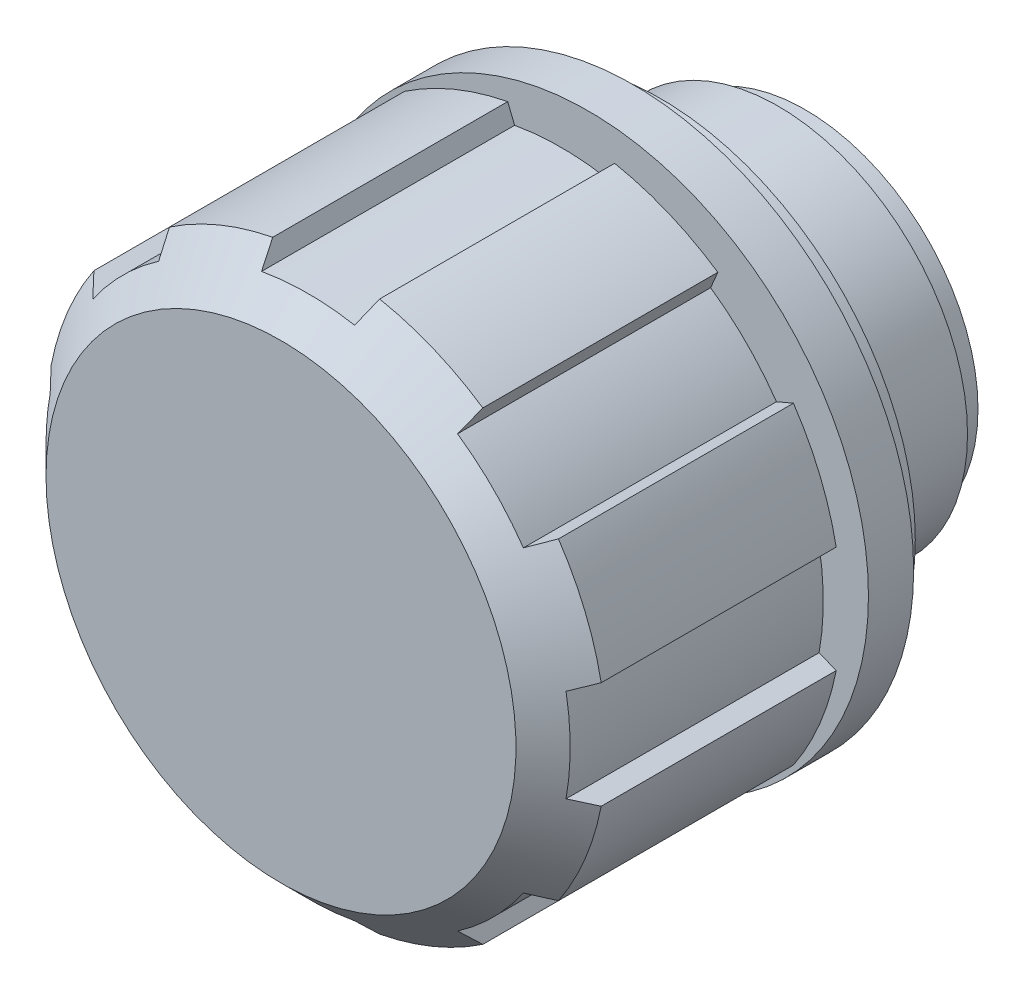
ISO-10303-21;
HEADER;
FILE_DESCRIPTION(('STEP AP214'),'2;1');
FILE_NAME('part.step','',(''),(''),'','','');
FILE_SCHEMA(('AUTOMOTIVE_DESIGN { 1 0 10303 214 1 1 1 1 }'));
ENDSEC;
DATA;
#1=APPLICATION_CONTEXT('core data for automotive mechanical design processes');
#2=APPLICATION_PROTOCOL_DEFINITION('international standard','automotive_design',2000,#1);
#3=PRODUCT_CONTEXT('',#1,'mechanical');
#4=PRODUCT('Part','Part','',(#3));
#5=PRODUCT_RELATED_PRODUCT_CATEGORY('part','',(#4));
#6=PRODUCT_DEFINITION_FORMATION('','',#4);
#7=PRODUCT_DEFINITION_CONTEXT('part definition',#1,'design');
#8=PRODUCT_DEFINITION('design','',#6,#7);
#9=PRODUCT_DEFINITION_SHAPE('','',#8);
#10=(LENGTH_UNIT() NAMED_UNIT(*) SI_UNIT(.MILLI.,.METRE.));
#11=(NAMED_UNIT(*) PLANE_ANGLE_UNIT() SI_UNIT($,.RADIAN.));
#12=(NAMED_UNIT(*) SI_UNIT($,.STERADIAN.) SOLID_ANGLE_UNIT());
#13=UNCERTAINTY_MEASURE_WITH_UNIT(LENGTH_MEASURE(1.E-05),#10,'distance_accuracy_value','');
#14=(GEOMETRIC_REPRESENTATION_CONTEXT(3) GLOBAL_UNCERTAINTY_ASSIGNED_CONTEXT((#13)) GLOBAL_UNIT_ASSIGNED_CONTEXT((#10,
#11,#12)) REPRESENTATION_CONTEXT('',''));
#15=CARTESIAN_POINT('',(0.,0.,0.));
#16=DIRECTION('',(0.,0.,1.));
#17=DIRECTION('',(1.,0.,0.));
#18=AXIS2_PLACEMENT_3D('',#15,#16,#17);
#19=CARTESIAN_POINT('',(0.,6.5,21.));
#20=DIRECTION('',(0.,0.,1.));
#21=DIRECTION('',(1.,0.,0.));
#22=AXIS2_PLACEMENT_3D('',#19,#20,#21);
#23=PLANE('',#22);
#24=CARTESIAN_POINT('',(0.,0.,21.));
#25=DIRECTION('',(0.,0.,-1.));
#26=DIRECTION('',(-1.,0.,0.));
#27=AXIS2_PLACEMENT_3D('',#24,#25,#26);
#28=CIRCLE('',#27,13.);
#29=CARTESIAN_POINT('',(-13.,0.,21.));
#30=VERTEX_POINT('',#29);
#31=EDGE_CURVE('E656',#30,#30,#28,.T.);
#32=ORIENTED_EDGE('',*,*,#31,.F.);
#33=EDGE_LOOP('',(#32));
#34=FACE_BOUND('',#33,.T.);
#35=ADVANCED_FACE('F14',(#34),#23,.T.);
#36=CARTESIAN_POINT('',(-8.26892569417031,11.9111237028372,21.5));
#37=DIRECTION('',(0.92050485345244,0.390731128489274,0.));
#38=DIRECTION('',(-0.390731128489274,0.92050485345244,0.));
#39=AXIS2_PLACEMENT_3D('',#36,#37,#38);
#40=PLANE('',#39);
#41=DIRECTION('',(0.,0.,1.));
#42=VECTOR('',#41,1.);
#43=CARTESIAN_POINT('',(-8.66749000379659,12.8500823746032,21.5));
#44=LINE('',#43,#42);
#45=CARTESIAN_POINT('',(-8.66749000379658,12.8500823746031,5.5));
#46=VERTEX_POINT('',#45);
#47=CARTESIAN_POINT('',(-8.66749000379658,12.8500823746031,18.5));
#48=VERTEX_POINT('',#47);
#49=EDGE_CURVE('E731',#46,#48,#44,.T.);
#50=ORIENTED_EDGE('',*,*,#49,.F.);
#51=DIRECTION('',(-0.390731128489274,0.92050485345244,0.));
#52=VECTOR('',#51,1.);
#53=CARTESIAN_POINT('',(-8.26892569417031,11.9111237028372,5.5));
#54=LINE('',#53,#52);
#55=CARTESIAN_POINT('',(-8.26892569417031,11.9111237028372,5.5));
#56=VERTEX_POINT('',#55);
#57=EDGE_CURVE('E308',#56,#46,#54,.T.);
#58=ORIENTED_EDGE('',*,*,#57,.F.);
#59=DIRECTION('',(0.,0.,1.));
#60=VECTOR('',#59,1.);
#61=CARTESIAN_POINT('',(-8.26892569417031,11.9111237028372,21.5));
#62=LINE('',#61,#60);
#63=CARTESIAN_POINT('',(-8.26892569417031,11.9111237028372,19.5));
#64=VERTEX_POINT('',#63);
#65=EDGE_CURVE('E322',#64,#56,#62,.F.);
#66=ORIENTED_EDGE('',*,*,#65,.F.);
#67=CARTESIAN_POINT('',(-8.66749000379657,12.8500823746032,18.5));
#68=CARTESIAN_POINT('',(-8.60110656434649,12.6936927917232,18.6667813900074));
#69=CARTESIAN_POINT('',(-8.53470115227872,12.5372514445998,18.8335054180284));
#70=CARTESIAN_POINT('',(-8.40184638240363,12.2242652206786,19.1668387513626));
#71=CARTESIAN_POINT('',(-8.33539702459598,12.06772034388,19.3334480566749));
#72=CARTESIAN_POINT('',(-8.26892569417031,11.9111237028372,19.5));
#73=B_SPLINE_CURVE_WITH_KNOTS('',3,(#67,#68,#69,#70,#71,#72),.UNSPECIFIED.,.F.,.F.,(4,2,4),(0.,
0.714229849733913,1.42845970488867),.UNSPECIFIED.);
#74=EDGE_CURVE('E396',#48,#64,#73,.T.);
#75=ORIENTED_EDGE('',*,*,#74,.F.);
#76=EDGE_LOOP('',(#50,#58,#66,#75));
#77=FACE_BOUND('',#76,.T.);
#78=ADVANCED_FACE('F515',(#77),#40,.F.);
#79=CARTESIAN_POINT('',(-2.95753942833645,15.2152213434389,21.5));
#80=DIRECTION('',(-0.927183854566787,-0.374606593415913,0.));
#81=DIRECTION('',(0.374606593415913,-0.927183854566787,0.));
#82=AXIS2_PLACEMENT_3D('',#79,#80,#81);
#83=PLANE('',#82);
#84=DIRECTION('',(0.,0.,1.));
#85=VECTOR('',#84,1.);
#86=CARTESIAN_POINT('',(-2.5754229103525,14.2694497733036,21.5));
#87=LINE('',#86,#85);
#88=CARTESIAN_POINT('',(-2.5754229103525,14.2694497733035,5.5));
#89=VERTEX_POINT('',#88);
#90=CARTESIAN_POINT('',(-2.5754229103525,14.2694497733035,19.5));
#91=VERTEX_POINT('',#90);
#92=EDGE_CURVE('E310',#89,#91,#87,.T.);
#93=ORIENTED_EDGE('',*,*,#92,.F.);
#94=DIRECTION('',(0.374606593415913,-0.927183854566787,0.));
#95=VECTOR('',#94,1.);
#96=CARTESIAN_POINT('',(-2.95753942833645,15.2152213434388,5.5));
#97=LINE('',#96,#95);
#98=CARTESIAN_POINT('',(-2.95753942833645,15.2152213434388,5.5));
#99=VERTEX_POINT('',#98);
#100=EDGE_CURVE('E301',#99,#89,#97,.T.);
#101=ORIENTED_EDGE('',*,*,#100,.F.);
#102=DIRECTION('',(0.,0.,1.));
#103=VECTOR('',#102,1.);
#104=CARTESIAN_POINT('',(-2.95753942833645,15.2152213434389,21.5));
#105=LINE('',#104,#103);
#106=CARTESIAN_POINT('',(-2.95753942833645,15.2152213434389,18.5));
#107=VERTEX_POINT('',#106);
#108=EDGE_CURVE('E318',#107,#99,#105,.F.);
#109=ORIENTED_EDGE('',*,*,#108,.F.);
#110=CARTESIAN_POINT('',(-2.57542291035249,14.2694497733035,19.5));
#111=CARTESIAN_POINT('',(-2.63915112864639,14.4271826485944,19.3334480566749));
#112=CARTESIAN_POINT('',(-2.70285828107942,14.58486338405,19.1668387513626));
#113=CARTESIAN_POINT('',(-2.83023045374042,14.9001205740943,18.8335054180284));
#114=CARTESIAN_POINT('',(-2.8938954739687,15.0576970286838,18.6667813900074));
#115=CARTESIAN_POINT('',(-2.95753942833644,15.2152213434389,18.5));
#116=B_SPLINE_CURVE_WITH_KNOTS('',3,(#110,#111,#112,#113,#114,#115),.UNSPECIFIED.,.F.,.F.,(4,2,
4),(0.,0.714229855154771,1.4284597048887),.UNSPECIFIED.);
#117=EDGE_CURVE('E498',#91,#107,#116,.T.);
#118=ORIENTED_EDGE('',*,*,#117,.F.);
#119=EDGE_LOOP('',(#93,#101,#109,#118));
#120=FACE_BOUND('',#119,.T.);
#121=ADVANCED_FACE('F511',(#120),#83,.F.);
#122=CARTESIAN_POINT('',(2.5754229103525,14.2694497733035,21.5));
#123=DIRECTION('',(0.927183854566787,-0.374606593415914,0.));
#124=DIRECTION('',(0.374606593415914,0.927183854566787,0.));
#125=AXIS2_PLACEMENT_3D('',#122,#123,#124);
#126=PLANE('',#125);
#127=DIRECTION('',(0.,0.,1.));
#128=VECTOR('',#127,1.);
#129=CARTESIAN_POINT('',(2.95753942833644,15.2152213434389,21.5));
#130=LINE('',#129,#128);
#131=CARTESIAN_POINT('',(2.95753942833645,15.2152213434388,5.5));
#132=VERTEX_POINT('',#131);
#133=CARTESIAN_POINT('',(2.95753942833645,15.2152213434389,18.5));
#134=VERTEX_POINT('',#133);
#135=EDGE_CURVE('E299',#132,#134,#130,.T.);
#136=ORIENTED_EDGE('',*,*,#135,.F.);
#137=DIRECTION('',(0.374606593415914,0.927183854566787,0.));
#138=VECTOR('',#137,1.);
#139=CARTESIAN_POINT('',(2.5754229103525,14.2694497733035,5.5));
#140=LINE('',#139,#138);
#141=CARTESIAN_POINT('',(2.5754229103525,14.2694497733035,5.5));
#142=VERTEX_POINT('',#141);
#143=EDGE_CURVE('E294',#142,#132,#140,.T.);
#144=ORIENTED_EDGE('',*,*,#143,.F.);
#145=DIRECTION('',(0.,0.,1.));
#146=VECTOR('',#145,1.);
#147=CARTESIAN_POINT('',(2.5754229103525,14.2694497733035,21.5));
#148=LINE('',#147,#146);
#149=CARTESIAN_POINT('',(2.5754229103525,14.2694497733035,19.5));
#150=VERTEX_POINT('',#149);
#151=EDGE_CURVE('E728',#150,#142,#148,.F.);
#152=ORIENTED_EDGE('',*,*,#151,.F.);
#153=CARTESIAN_POINT('',(2.95753942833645,15.2152213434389,18.5));
#154=CARTESIAN_POINT('',(2.89389547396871,15.0576970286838,18.6667813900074));
#155=CARTESIAN_POINT('',(2.83023045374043,14.9001205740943,18.8335054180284));
#156=CARTESIAN_POINT('',(2.70285828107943,14.58486338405,19.1668387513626));
#157=CARTESIAN_POINT('',(2.63915112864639,14.4271826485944,19.3334480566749));
#158=CARTESIAN_POINT('',(2.5754229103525,14.2694497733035,19.5));
#159=B_SPLINE_CURVE_WITH_KNOTS('',3,(#153,#154,#155,#156,#157,#158),.UNSPECIFIED.,.F.,.F.,(4,2,
4),(0.,0.714229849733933,1.4284597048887),.UNSPECIFIED.);
#160=EDGE_CURVE('E407',#134,#150,#159,.T.);
#161=ORIENTED_EDGE('',*,*,#160,.F.);
#162=EDGE_LOOP('',(#136,#144,#152,#161));
#163=FACE_BOUND('',#162,.T.);
#164=ADVANCED_FACE('F514',(#163),#126,.F.);
#165=CARTESIAN_POINT('',(8.66749000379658,12.8500823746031,21.5));
#166=DIRECTION('',(-0.92050485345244,0.390731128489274,0.));
#167=DIRECTION('',(-0.390731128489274,-0.92050485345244,0.));
#168=AXIS2_PLACEMENT_3D('',#165,#166,#167);
#169=PLANE('',#168);
#170=DIRECTION('',(0.,0.,1.));
#171=VECTOR('',#170,1.);
#172=CARTESIAN_POINT('',(8.26892569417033,11.9111237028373,21.5));
#173=LINE('',#172,#171);
#174=CARTESIAN_POINT('',(8.26892569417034,11.9111237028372,5.5));
#175=VERTEX_POINT('',#174);
#176=CARTESIAN_POINT('',(8.26892569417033,11.9111237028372,19.5));
#177=VERTEX_POINT('',#176);
#178=EDGE_CURVE('E292',#175,#177,#173,.T.);
#179=ORIENTED_EDGE('',*,*,#178,.F.);
#180=DIRECTION('',(-0.390731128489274,-0.92050485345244,0.));
#181=VECTOR('',#180,1.);
#182=CARTESIAN_POINT('',(8.66749000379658,12.8500823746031,5.5));
#183=LINE('',#182,#181);
#184=CARTESIAN_POINT('',(8.6674900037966,12.8500823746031,5.5));
#185=VERTEX_POINT('',#184);
#186=EDGE_CURVE('E287',#185,#175,#183,.T.);
#187=ORIENTED_EDGE('',*,*,#186,.F.);
#188=DIRECTION('',(0.,0.,1.));
#189=VECTOR('',#188,1.);
#190=CARTESIAN_POINT('',(8.6674900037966,12.8500823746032,21.5));
#191=LINE('',#190,#189);
#192=CARTESIAN_POINT('',(8.6674900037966,12.8500823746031,18.5));
#193=VERTEX_POINT('',#192);
#194=EDGE_CURVE('E305',#193,#185,#191,.F.);
#195=ORIENTED_EDGE('',*,*,#194,.F.);
#196=CARTESIAN_POINT('',(8.26892569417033,11.9111237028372,19.5));
#197=CARTESIAN_POINT('',(8.335397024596,12.06772034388,19.3334480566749));
#198=CARTESIAN_POINT('',(8.40184638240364,12.2242652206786,19.1668387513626));
#199=CARTESIAN_POINT('',(8.53470115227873,12.5372514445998,18.8335054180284));
#200=CARTESIAN_POINT('',(8.6011065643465,12.6936927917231,18.6667813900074));
#201=CARTESIAN_POINT('',(8.66749000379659,12.8500823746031,18.5));
#202=B_SPLINE_CURVE_WITH_KNOTS('',3,(#196,#197,#198,#199,#200,#201),.UNSPECIFIED.,.F.,.F.,(4,2,
4),(0.,0.714229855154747,1.42845970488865),.UNSPECIFIED.);
#203=EDGE_CURVE('E415',#177,#193,#202,.T.);
#204=ORIENTED_EDGE('',*,*,#203,.F.);
#205=EDGE_LOOP('',(#179,#187,#195,#204));
#206=FACE_BOUND('',#205,.T.);
#207=ADVANCED_FACE('F745',(#206),#169,.F.);
#208=CARTESIAN_POINT('',(11.9111237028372,8.26892569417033,21.5));
#209=DIRECTION('',(0.390731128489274,-0.92050485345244,0.));
#210=DIRECTION('',(0.92050485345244,0.390731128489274,0.));
#211=AXIS2_PLACEMENT_3D('',#208,#209,#210);
#212=PLANE('',#211);
#213=DIRECTION('',(0.,0.,1.));
#214=VECTOR('',#213,1.);
#215=CARTESIAN_POINT('',(12.8500823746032,8.6674900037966,21.5));
#216=LINE('',#215,#214);
#217=CARTESIAN_POINT('',(12.8500823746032,8.66749000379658,5.5));
#218=VERTEX_POINT('',#217);
#219=CARTESIAN_POINT('',(12.8500823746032,8.6674900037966,18.5));
#220=VERTEX_POINT('',#219);
#221=EDGE_CURVE('E285',#218,#220,#216,.T.);
#222=ORIENTED_EDGE('',*,*,#221,.F.);
#223=DIRECTION('',(0.92050485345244,0.390731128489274,0.));
#224=VECTOR('',#223,1.);
#225=CARTESIAN_POINT('',(11.9111237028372,8.26892569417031,5.5));
#226=LINE('',#225,#224);
#227=CARTESIAN_POINT('',(11.9111237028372,8.26892569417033,5.5));
#228=VERTEX_POINT('',#227);
#229=EDGE_CURVE('E280',#228,#218,#226,.T.);
#230=ORIENTED_EDGE('',*,*,#229,.F.);
#231=DIRECTION('',(0.,0.,1.));
#232=VECTOR('',#231,1.);
#233=CARTESIAN_POINT('',(11.9111237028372,8.26892569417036,21.5));
#234=LINE('',#233,#232);
#235=CARTESIAN_POINT('',(11.9111237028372,8.26892569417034,19.5));
#236=VERTEX_POINT('',#235);
#237=EDGE_CURVE('E298',#236,#228,#234,.F.);
#238=ORIENTED_EDGE('',*,*,#237,.F.);
#239=CARTESIAN_POINT('',(12.8500823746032,8.6674900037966,18.5));
#240=CARTESIAN_POINT('',(12.6936927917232,8.60110656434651,18.6667813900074));
#241=CARTESIAN_POINT('',(12.5372514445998,8.53470115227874,18.8335054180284));
#242=CARTESIAN_POINT('',(12.2242652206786,8.40184638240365,19.1668387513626));
#243=CARTESIAN_POINT('',(12.06772034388,8.335397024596,19.3334480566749));
#244=CARTESIAN_POINT('',(11.9111237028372,8.26892569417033,19.5));
#245=B_SPLINE_CURVE_WITH_KNOTS('',3,(#239,#240,#241,#242,#243,#244),.UNSPECIFIED.,.F.,.F.,(4,2,
4),(0.,0.714229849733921,1.42845970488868),.UNSPECIFIED.);
#246=EDGE_CURVE('E423',#220,#236,#245,.T.);
#247=ORIENTED_EDGE('',*,*,#246,.F.);
#248=EDGE_LOOP('',(#222,#230,#238,#247));
#249=FACE_BOUND('',#248,.T.);
#250=ADVANCED_FACE('F751',(#249),#212,.F.);
#251=CARTESIAN_POINT('',(15.2152213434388,2.95753942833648,21.5));
#252=DIRECTION('',(-0.374606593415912,0.927183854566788,0.));
#253=DIRECTION('',(-0.927183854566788,-0.374606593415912,0.));
#254=AXIS2_PLACEMENT_3D('',#251,#252,#253);
#255=PLANE('',#254);
#256=DIRECTION('',(0.,0.,1.));
#257=VECTOR('',#256,1.);
#258=CARTESIAN_POINT('',(14.2694497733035,2.57542291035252,21.5));
#259=LINE('',#258,#257);
#260=CARTESIAN_POINT('',(14.2694497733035,2.57542291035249,5.5));
#261=VERTEX_POINT('',#260);
#262=CARTESIAN_POINT('',(14.2694497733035,2.57542291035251,19.5));
#263=VERTEX_POINT('',#262);
#264=EDGE_CURVE('E278',#261,#263,#259,.T.);
#265=ORIENTED_EDGE('',*,*,#264,.F.);
#266=DIRECTION('',(-0.927183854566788,-0.374606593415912,0.));
#267=VECTOR('',#266,1.);
#268=CARTESIAN_POINT('',(15.2152213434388,2.95753942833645,5.5));
#269=LINE('',#268,#267);
#270=CARTESIAN_POINT('',(15.2152213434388,2.95753942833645,5.5));
#271=VERTEX_POINT('',#270);
#272=EDGE_CURVE('E273',#271,#261,#269,.T.);
#273=ORIENTED_EDGE('',*,*,#272,.F.);
#274=DIRECTION('',(0.,0.,1.));
#275=VECTOR('',#274,1.);
#276=CARTESIAN_POINT('',(15.2152213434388,2.95753942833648,21.5));
#277=LINE('',#276,#275);
#278=CARTESIAN_POINT('',(15.2152213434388,2.95753942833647,18.5));
#279=VERTEX_POINT('',#278);
#280=EDGE_CURVE('E291',#279,#271,#277,.F.);
#281=ORIENTED_EDGE('',*,*,#280,.F.);
#282=CARTESIAN_POINT('',(14.2694497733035,2.57542291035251,19.5));
#283=CARTESIAN_POINT('',(14.4271826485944,2.63915112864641,19.3334480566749));
#284=CARTESIAN_POINT('',(14.58486338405,2.70285828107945,19.1668387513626));
#285=CARTESIAN_POINT('',(14.9001205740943,2.83023045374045,18.8335054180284));
#286=CARTESIAN_POINT('',(15.0576970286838,2.89389547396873,18.6667813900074));
#287=CARTESIAN_POINT('',(15.2152213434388,2.95753942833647,18.5));
#288=B_SPLINE_CURVE_WITH_KNOTS('',3,(#282,#283,#284,#285,#286,#287),.UNSPECIFIED.,.F.,.F.,(4,2,
4),(0.,0.714229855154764,1.42845970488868),.UNSPECIFIED.);
#289=EDGE_CURVE('E431',#263,#279,#288,.T.);
#290=ORIENTED_EDGE('',*,*,#289,.F.);
#291=EDGE_LOOP('',(#265,#273,#281,#290));
#292=FACE_BOUND('',#291,.T.);
#293=ADVANCED_FACE('F755',(#292),#255,.F.);
#294=CARTESIAN_POINT('',(14.2694497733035,-2.57542291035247,21.5));
#295=DIRECTION('',(-0.374606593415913,-0.927183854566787,0.));
#296=DIRECTION('',(0.927183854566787,-0.374606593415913,0.));
#297=AXIS2_PLACEMENT_3D('',#294,#295,#296);
#298=PLANE('',#297);
#299=DIRECTION('',(0.,0.,1.));
#300=VECTOR('',#299,1.);
#301=CARTESIAN_POINT('',(15.2152213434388,-2.95753942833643,21.5));
#302=LINE('',#301,#300);
#303=CARTESIAN_POINT('',(15.2152213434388,-2.95753942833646,5.5));
#304=VERTEX_POINT('',#303);
#305=CARTESIAN_POINT('',(15.2152213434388,-2.95753942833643,18.5));
#306=VERTEX_POINT('',#305);
#307=EDGE_CURVE('E271',#304,#306,#302,.T.);
#308=ORIENTED_EDGE('',*,*,#307,.F.);
#309=DIRECTION('',(0.927183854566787,-0.374606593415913,0.));
#310=VECTOR('',#309,1.);
#311=CARTESIAN_POINT('',(14.2694497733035,-2.5754229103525,5.5));
#312=LINE('',#311,#310);
#313=CARTESIAN_POINT('',(14.2694497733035,-2.57542291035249,5.5));
#314=VERTEX_POINT('',#313);
#315=EDGE_CURVE('E266',#314,#304,#312,.T.);
#316=ORIENTED_EDGE('',*,*,#315,.F.);
#317=DIRECTION('',(0.,0.,1.));
#318=VECTOR('',#317,1.);
#319=CARTESIAN_POINT('',(14.2694497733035,-2.57542291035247,21.5));
#320=LINE('',#319,#318);
#321=CARTESIAN_POINT('',(14.2694497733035,-2.57542291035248,19.5));
#322=VERTEX_POINT('',#321);
#323=EDGE_CURVE('E284',#322,#314,#320,.F.);
#324=ORIENTED_EDGE('',*,*,#323,.F.);
#325=CARTESIAN_POINT('',(15.2152213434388,-2.95753942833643,18.5));
#326=CARTESIAN_POINT('',(15.0576970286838,-2.89389547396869,18.6667813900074));
#327=CARTESIAN_POINT('',(14.9001205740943,-2.83023045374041,18.8335054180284));
#328=CARTESIAN_POINT('',(14.58486338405,-2.70285828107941,19.1668387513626));
#329=CARTESIAN_POINT('',(14.4271826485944,-2.63915112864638,19.3334480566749));
#330=CARTESIAN_POINT('',(14.2694497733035,-2.57542291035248,19.5));
#331=B_SPLINE_CURVE_WITH_KNOTS('',3,(#325,#326,#327,#328,#329,#330),.UNSPECIFIED.,.F.,.F.,(4,2,
4),(0.,0.714229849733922,1.42845970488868),.UNSPECIFIED.);
#332=EDGE_CURVE('E439',#306,#322,#331,.T.);
#333=ORIENTED_EDGE('',*,*,#332,.F.);
#334=EDGE_LOOP('',(#308,#316,#324,#333));
#335=FACE_BOUND('',#334,.T.);
#336=ADVANCED_FACE('F760',(#335),#298,.F.);
#337=CARTESIAN_POINT('',(12.8500823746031,-8.66749000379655,21.5));
#338=DIRECTION('',(0.390731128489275,0.92050485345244,0.));
#339=DIRECTION('',(-0.92050485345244,0.390731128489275,0.));
#340=AXIS2_PLACEMENT_3D('',#337,#338,#339);
#341=PLANE('',#340);
#342=DIRECTION('',(0.,0.,1.));
#343=VECTOR('',#342,1.);
#344=CARTESIAN_POINT('',(11.9111237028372,-8.26892569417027,21.5));
#345=LINE('',#344,#343);
#346=CARTESIAN_POINT('',(11.9111237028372,-8.26892569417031,5.5));
#347=VERTEX_POINT('',#346);
#348=CARTESIAN_POINT('',(11.9111237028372,-8.26892569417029,19.5));
#349=VERTEX_POINT('',#348);
#350=EDGE_CURVE('E264',#347,#349,#345,.T.);
#351=ORIENTED_EDGE('',*,*,#350,.F.);
#352=DIRECTION('',(-0.92050485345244,0.390731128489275,0.));
#353=VECTOR('',#352,1.);
#354=CARTESIAN_POINT('',(12.8500823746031,-8.66749000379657,5.5));
#355=LINE('',#354,#353);
#356=CARTESIAN_POINT('',(12.8500823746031,-8.6674900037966,5.5));
#357=VERTEX_POINT('',#356);
#358=EDGE_CURVE('E261',#357,#347,#355,.T.);
#359=ORIENTED_EDGE('',*,*,#358,.F.);
#360=DIRECTION('',(0.,0.,1.));
#361=VECTOR('',#360,1.);
#362=CARTESIAN_POINT('',(12.8500823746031,-8.66749000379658,21.5));
#363=LINE('',#362,#361);
#364=CARTESIAN_POINT('',(12.8500823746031,-8.66749000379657,18.5));
#365=VERTEX_POINT('',#364);
#366=EDGE_CURVE('E277',#365,#357,#363,.F.);
#367=ORIENTED_EDGE('',*,*,#366,.F.);
#368=CARTESIAN_POINT('',(11.9111237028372,-8.2689256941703,19.5));
#369=CARTESIAN_POINT('',(12.06772034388,-8.33539702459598,19.3334480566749));
#370=CARTESIAN_POINT('',(12.2242652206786,-8.40184638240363,19.1668387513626));
#371=CARTESIAN_POINT('',(12.5372514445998,-8.53470115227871,18.8335054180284));
#372=CARTESIAN_POINT('',(12.6936927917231,-8.60110656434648,18.6667813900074));
#373=CARTESIAN_POINT('',(12.8500823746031,-8.66749000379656,18.5));
#374=B_SPLINE_CURVE_WITH_KNOTS('',3,(#368,#369,#370,#371,#372,#373),.UNSPECIFIED.,.F.,.F.,(4,2,
4),(0.,0.714229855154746,1.42845970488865),.UNSPECIFIED.);
#375=EDGE_CURVE('E447',#349,#365,#374,.T.);
#376=ORIENTED_EDGE('',*,*,#375,.F.);
#377=EDGE_LOOP('',(#351,#359,#367,#376));
#378=FACE_BOUND('',#377,.T.);
#379=ADVANCED_FACE('F764',(#378),#341,.F.);
#380=CARTESIAN_POINT('',(8.2689256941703,-11.9111237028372,21.5));
#381=DIRECTION('',(-0.92050485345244,-0.390731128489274,0.));
#382=DIRECTION('',(0.390731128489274,-0.92050485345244,0.));
#383=AXIS2_PLACEMENT_3D('',#380,#381,#382);
#384=PLANE('',#383);
#385=DIRECTION('',(0.,0.,1.));
#386=VECTOR('',#385,1.);
#387=CARTESIAN_POINT('',(8.66749000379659,-12.8500823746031,21.5));
#388=LINE('',#387,#386);
#389=CARTESIAN_POINT('',(8.66749000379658,-12.8500823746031,5.5));
#390=VERTEX_POINT('',#389);
#391=CARTESIAN_POINT('',(8.66749000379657,-12.8500823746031,18.5));
#392=VERTEX_POINT('',#391);
#393=EDGE_CURVE('E705',#390,#392,#388,.T.);
#394=ORIENTED_EDGE('',*,*,#393,.F.);
#395=DIRECTION('',(0.390731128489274,-0.92050485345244,0.));
#396=VECTOR('',#395,1.);
#397=CARTESIAN_POINT('',(8.2689256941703,-11.9111237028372,5.5));
#398=LINE('',#397,#396);
#399=CARTESIAN_POINT('',(8.26892569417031,-11.9111237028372,5.5));
#400=VERTEX_POINT('',#399);
#401=EDGE_CURVE('E259',#400,#390,#398,.T.);
#402=ORIENTED_EDGE('',*,*,#401,.F.);
#403=DIRECTION('',(0.,0.,1.));
#404=VECTOR('',#403,1.);
#405=CARTESIAN_POINT('',(8.26892569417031,-11.9111237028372,21.5));
#406=LINE('',#405,#404);
#407=CARTESIAN_POINT('',(8.2689256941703,-11.9111237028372,19.5));
#408=VERTEX_POINT('',#407);
#409=EDGE_CURVE('E270',#408,#400,#406,.F.);
#410=ORIENTED_EDGE('',*,*,#409,.F.);
#411=CARTESIAN_POINT('',(8.66749000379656,-12.8500823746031,18.5));
#412=CARTESIAN_POINT('',(8.60110656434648,-12.6936927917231,18.6667813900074));
#413=CARTESIAN_POINT('',(8.53470115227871,-12.5372514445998,18.8335054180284));
#414=CARTESIAN_POINT('',(8.40184638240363,-12.2242652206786,19.1668387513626));
#415=CARTESIAN_POINT('',(8.33539702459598,-12.0677203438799,19.333448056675));
#416=CARTESIAN_POINT('',(8.2689256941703,-11.9111237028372,19.5));
#417=B_SPLINE_CURVE_WITH_KNOTS('',3,(#411,#412,#413,#414,#415,#416),.UNSPECIFIED.,.F.,.F.,(4,2,
4),(0.,0.714229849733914,1.42845970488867),.UNSPECIFIED.);
#418=EDGE_CURVE('E241',#392,#408,#417,.T.);
#419=ORIENTED_EDGE('',*,*,#418,.F.);
#420=EDGE_LOOP('',(#394,#402,#410,#419));
#421=FACE_BOUND('',#420,.T.);
#422=ADVANCED_FACE('F701',(#421),#384,.F.);
#423=CARTESIAN_POINT('',(2.95753942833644,-15.2152213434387,21.5));
#424=DIRECTION('',(0.927183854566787,0.374606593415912,0.));
#425=DIRECTION('',(-0.374606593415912,0.927183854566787,0.));
#426=AXIS2_PLACEMENT_3D('',#423,#424,#425);
#427=PLANE('',#426);
#428=DIRECTION('',(0.,0.,1.));
#429=VECTOR('',#428,1.);
#430=CARTESIAN_POINT('',(2.57542291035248,-14.2694497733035,21.5));
#431=LINE('',#430,#429);
#432=CARTESIAN_POINT('',(2.57542291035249,-14.2694497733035,5.5));
#433=VERTEX_POINT('',#432);
#434=CARTESIAN_POINT('',(2.57542291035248,-14.2694497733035,19.5));
#435=VERTEX_POINT('',#434);
#436=EDGE_CURVE('E220',#433,#435,#431,.T.);
#437=ORIENTED_EDGE('',*,*,#436,.F.);
#438=DIRECTION('',(-0.374606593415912,0.927183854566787,0.));
#439=VECTOR('',#438,1.);
#440=CARTESIAN_POINT('',(2.95753942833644,-15.2152213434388,5.5));
#441=LINE('',#440,#439);
#442=CARTESIAN_POINT('',(2.95753942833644,-15.2152213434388,5.5));
#443=VERTEX_POINT('',#442);
#444=EDGE_CURVE('E242',#443,#433,#441,.T.);
#445=ORIENTED_EDGE('',*,*,#444,.F.);
#446=DIRECTION('',(0.,0.,1.));
#447=VECTOR('',#446,1.);
#448=CARTESIAN_POINT('',(2.95753942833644,-15.2152213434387,21.5));
#449=LINE('',#448,#447);
#450=CARTESIAN_POINT('',(2.95753942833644,-15.2152213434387,18.5));
#451=VERTEX_POINT('',#450);
#452=EDGE_CURVE('E237',#451,#443,#449,.F.);
#453=ORIENTED_EDGE('',*,*,#452,.F.);
#454=CARTESIAN_POINT('',(2.57542291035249,-14.2694497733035,19.5));
#455=CARTESIAN_POINT('',(2.63915112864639,-14.4271826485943,19.333448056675));
#456=CARTESIAN_POINT('',(2.70285828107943,-14.5848633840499,19.1668387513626));
#457=CARTESIAN_POINT('',(2.83023045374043,-14.9001205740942,18.8335054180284));
#458=CARTESIAN_POINT('',(2.8938954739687,-15.0576970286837,18.6667813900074));
#459=CARTESIAN_POINT('',(2.95753942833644,-15.2152213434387,18.5));
#460=B_SPLINE_CURVE_WITH_KNOTS('',3,(#454,#455,#456,#457,#458,#459),.UNSPECIFIED.,.F.,.F.,(4,2,
4),(0.,0.714229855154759,1.42845970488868),.UNSPECIFIED.);
#461=EDGE_CURVE('E234',#435,#451,#460,.T.);
#462=ORIENTED_EDGE('',*,*,#461,.F.);
#463=EDGE_LOOP('',(#437,#445,#453,#462));
#464=FACE_BOUND('',#463,.T.);
#465=ADVANCED_FACE('F235',(#464),#427,.F.);
#466=CARTESIAN_POINT('',(-2.5754229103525,-14.2694497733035,21.5));
#467=DIRECTION('',(-0.927183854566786,0.374606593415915,0.));
#468=DIRECTION('',(-0.374606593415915,-0.927183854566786,0.));
#469=AXIS2_PLACEMENT_3D('',#466,#467,#468);
#470=PLANE('',#469);
#471=DIRECTION('',(0.,0.,1.));
#472=VECTOR('',#471,1.);
#473=CARTESIAN_POINT('',(-2.95753942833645,-15.2152213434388,21.5));
#474=LINE('',#473,#472);
#475=CARTESIAN_POINT('',(-2.95753942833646,-15.2152213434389,5.5));
#476=VERTEX_POINT('',#475);
#477=CARTESIAN_POINT('',(-2.95753942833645,-15.2152213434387,18.5));
#478=VERTEX_POINT('',#477);
#479=EDGE_CURVE('E684',#476,#478,#474,.T.);
#480=ORIENTED_EDGE('',*,*,#479,.F.);
#481=DIRECTION('',(-0.374606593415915,-0.927183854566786,0.));
#482=VECTOR('',#481,1.);
#483=CARTESIAN_POINT('',(-2.5754229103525,-14.2694497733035,5.5));
#484=LINE('',#483,#482);
#485=CARTESIAN_POINT('',(-2.57542291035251,-14.2694497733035,5.5));
#486=VERTEX_POINT('',#485);
#487=EDGE_CURVE('E679',#486,#476,#484,.T.);
#488=ORIENTED_EDGE('',*,*,#487,.F.);
#489=DIRECTION('',(0.,0.,1.));
#490=VECTOR('',#489,1.);
#491=CARTESIAN_POINT('',(-2.57542291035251,-14.2694497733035,21.5));
#492=LINE('',#491,#490);
#493=CARTESIAN_POINT('',(-2.5754229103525,-14.2694497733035,19.5));
#494=VERTEX_POINT('',#493);
#495=EDGE_CURVE('E230',#494,#486,#492,.F.);
#496=ORIENTED_EDGE('',*,*,#495,.F.);
#497=CARTESIAN_POINT('',(-2.95753942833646,-15.2152213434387,18.5));
#498=CARTESIAN_POINT('',(-2.89389547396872,-15.0576970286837,18.6667813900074));
#499=CARTESIAN_POINT('',(-2.83023045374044,-14.9001205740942,18.8335054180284));
#500=CARTESIAN_POINT('',(-2.70285828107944,-14.5848633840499,19.1668387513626));
#501=CARTESIAN_POINT('',(-2.6391511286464,-14.4271826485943,19.333448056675));
#502=CARTESIAN_POINT('',(-2.5754229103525,-14.2694497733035,19.5));
#503=B_SPLINE_CURVE_WITH_KNOTS('',3,(#497,#498,#499,#500,#501,#502),.UNSPECIFIED.,.F.,.F.,(4,2,
4),(0.,0.714229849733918,1.42845970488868),.UNSPECIFIED.);
#504=EDGE_CURVE('E248',#478,#494,#503,.T.);
#505=ORIENTED_EDGE('',*,*,#504,.F.);
#506=EDGE_LOOP('',(#480,#488,#496,#505));
#507=FACE_BOUND('',#506,.T.);
#508=ADVANCED_FACE('F1016',(#507),#470,.F.);
#509=CARTESIAN_POINT('',(-8.66749000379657,-12.8500823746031,21.5));
#510=DIRECTION('',(0.920504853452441,-0.390731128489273,0.));
#511=DIRECTION('',(0.390731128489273,0.920504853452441,0.));
#512=AXIS2_PLACEMENT_3D('',#509,#510,#511);
#513=PLANE('',#512);
#514=DIRECTION('',(0.,0.,1.));
#515=VECTOR('',#514,1.);
#516=CARTESIAN_POINT('',(-8.26892569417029,-11.9111237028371,21.5));
#517=LINE('',#516,#515);
#518=CARTESIAN_POINT('',(-8.2689256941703,-11.9111237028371,5.5));
#519=VERTEX_POINT('',#518);
#520=CARTESIAN_POINT('',(-8.2689256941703,-11.9111237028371,19.5));
#521=VERTEX_POINT('',#520);
#522=EDGE_CURVE('E677',#519,#521,#517,.T.);
#523=ORIENTED_EDGE('',*,*,#522,.F.);
#524=DIRECTION('',(0.390731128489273,0.920504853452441,0.));
#525=VECTOR('',#524,1.);
#526=CARTESIAN_POINT('',(-8.66749000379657,-12.8500823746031,5.5));
#527=LINE('',#526,#525);
#528=CARTESIAN_POINT('',(-8.66749000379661,-12.8500823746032,5.5));
#529=VERTEX_POINT('',#528);
#530=EDGE_CURVE('E673',#529,#519,#527,.T.);
#531=ORIENTED_EDGE('',*,*,#530,.F.);
#532=DIRECTION('',(0.,0.,1.));
#533=VECTOR('',#532,1.);
#534=CARTESIAN_POINT('',(-8.66749000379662,-12.8500823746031,21.5));
#535=LINE('',#534,#533);
#536=CARTESIAN_POINT('',(-8.6674900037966,-12.8500823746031,18.5));
#537=VERTEX_POINT('',#536);
#538=EDGE_CURVE('E253',#537,#529,#535,.F.);
#539=ORIENTED_EDGE('',*,*,#538,.F.);
#540=CARTESIAN_POINT('',(-8.26892569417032,-11.9111237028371,19.5));
#541=CARTESIAN_POINT('',(-8.33539702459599,-12.0677203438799,19.333448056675));
#542=CARTESIAN_POINT('',(-8.40184638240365,-12.2242652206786,19.1668387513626));
#543=CARTESIAN_POINT('',(-8.53470115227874,-12.5372514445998,18.8335054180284));
#544=CARTESIAN_POINT('',(-8.60110656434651,-12.6936927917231,18.6667813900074));
#545=CARTESIAN_POINT('',(-8.66749000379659,-12.8500823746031,18.5));
#546=B_SPLINE_CURVE_WITH_KNOTS('',3,(#540,#541,#542,#543,#544,#545),.UNSPECIFIED.,.F.,.F.,(4,2,
4),(0.,0.714229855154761,1.42845970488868),.UNSPECIFIED.);
#547=EDGE_CURVE('E478',#521,#537,#546,.T.);
#548=ORIENTED_EDGE('',*,*,#547,.F.);
#549=EDGE_LOOP('',(#523,#531,#539,#548));
#550=FACE_BOUND('',#549,.T.);
#551=ADVANCED_FACE('F1008',(#550),#513,.F.);
#552=CARTESIAN_POINT('',(-11.9111237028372,-8.26892569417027,21.5));
#553=DIRECTION('',(-0.390731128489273,0.920504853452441,0.));
#554=DIRECTION('',(-0.920504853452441,-0.390731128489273,0.));
#555=AXIS2_PLACEMENT_3D('',#552,#553,#554);
#556=PLANE('',#555);
#557=DIRECTION('',(0.,0.,1.));
#558=VECTOR('',#557,1.);
#559=CARTESIAN_POINT('',(-12.8500823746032,-8.66749000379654,21.5));
#560=LINE('',#559,#558);
#561=CARTESIAN_POINT('',(-12.8500823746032,-8.66749000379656,5.5));
#562=VERTEX_POINT('',#561);
#563=CARTESIAN_POINT('',(-12.8500823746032,-8.66749000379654,18.5));
#564=VERTEX_POINT('',#563);
#565=EDGE_CURVE('E671',#562,#564,#560,.T.);
#566=ORIENTED_EDGE('',*,*,#565,.F.);
#567=DIRECTION('',(-0.920504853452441,-0.390731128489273,0.));
#568=VECTOR('',#567,1.);
#569=CARTESIAN_POINT('',(-11.9111237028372,-8.26892569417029,5.5));
#570=LINE('',#569,#568);
#571=CARTESIAN_POINT('',(-11.9111237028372,-8.26892569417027,5.5));
#572=VERTEX_POINT('',#571);
#573=EDGE_CURVE('E504',#572,#562,#570,.T.);
#574=ORIENTED_EDGE('',*,*,#573,.F.);
#575=DIRECTION('',(0.,0.,1.));
#576=VECTOR('',#575,1.);
#577=CARTESIAN_POINT('',(-11.9111237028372,-8.26892569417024,21.5));
#578=LINE('',#577,#576);
#579=CARTESIAN_POINT('',(-11.9111237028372,-8.26892569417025,19.5));
#580=VERTEX_POINT('',#579);
#581=EDGE_CURVE('E683',#580,#572,#578,.F.);
#582=ORIENTED_EDGE('',*,*,#581,.F.);
#583=CARTESIAN_POINT('',(-12.8500823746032,-8.66749000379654,18.5));
#584=CARTESIAN_POINT('',(-12.6936927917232,-8.60110656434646,18.6667813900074));
#585=CARTESIAN_POINT('',(-12.5372514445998,-8.53470115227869,18.8335054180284));
#586=CARTESIAN_POINT('',(-12.2242652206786,-8.4018463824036,19.1668387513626));
#587=CARTESIAN_POINT('',(-12.06772034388,-8.33539702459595,19.3334480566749));
#588=CARTESIAN_POINT('',(-11.9111237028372,-8.26892569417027,19.5));
#589=B_SPLINE_CURVE_WITH_KNOTS('',3,(#583,#584,#585,#586,#587,#588),.UNSPECIFIED.,.F.,.F.,(4,2,
4),(0.,0.714229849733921,1.42845970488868),.UNSPECIFIED.);
#590=EDGE_CURVE('E485',#564,#580,#589,.T.);
#591=ORIENTED_EDGE('',*,*,#590,.F.);
#592=EDGE_LOOP('',(#566,#574,#582,#591));
#593=FACE_BOUND('',#592,.T.);
#594=ADVANCED_FACE('F1000',(#593),#556,.F.);
#595=CARTESIAN_POINT('',(-15.2152213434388,-2.95753942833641,21.5));
#596=DIRECTION('',(0.374606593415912,-0.927183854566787,0.));
#597=DIRECTION('',(0.927183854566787,0.374606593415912,0.));
#598=AXIS2_PLACEMENT_3D('',#595,#596,#597);
#599=PLANE('',#598);
#600=DIRECTION('',(0.,0.,1.));
#601=VECTOR('',#600,1.);
#602=CARTESIAN_POINT('',(-14.2694497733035,-2.57542291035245,21.5));
#603=LINE('',#602,#601);
#604=CARTESIAN_POINT('',(-14.2694497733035,-2.57542291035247,5.5));
#605=VERTEX_POINT('',#604);
#606=CARTESIAN_POINT('',(-14.2694497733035,-2.57542291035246,19.5));
#607=VERTEX_POINT('',#606);
#608=EDGE_CURVE('E666',#605,#607,#603,.T.);
#609=ORIENTED_EDGE('',*,*,#608,.F.);
#610=DIRECTION('',(0.927183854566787,0.374606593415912,0.));
#611=VECTOR('',#610,1.);
#612=CARTESIAN_POINT('',(-15.2152213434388,-2.95753942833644,5.5));
#613=LINE('',#612,#611);
#614=CARTESIAN_POINT('',(-15.2152213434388,-2.95753942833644,5.5));
#615=VERTEX_POINT('',#614);
#616=EDGE_CURVE('E501',#615,#605,#613,.T.);
#617=ORIENTED_EDGE('',*,*,#616,.F.);
#618=DIRECTION('',(0.,0.,1.));
#619=VECTOR('',#618,1.);
#620=CARTESIAN_POINT('',(-15.2152213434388,-2.95753942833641,21.5));
#621=LINE('',#620,#619);
#622=CARTESIAN_POINT('',(-15.2152213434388,-2.95753942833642,18.5));
#623=VERTEX_POINT('',#622);
#624=EDGE_CURVE('E676',#623,#615,#621,.F.);
#625=ORIENTED_EDGE('',*,*,#624,.F.);
#626=CARTESIAN_POINT('',(-14.2694497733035,-2.57542291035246,19.5));
#627=CARTESIAN_POINT('',(-14.4271826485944,-2.63915112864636,19.3334480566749));
#628=CARTESIAN_POINT('',(-14.58486338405,-2.7028582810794,19.1668387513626));
#629=CARTESIAN_POINT('',(-14.9001205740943,-2.8302304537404,18.8335054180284));
#630=CARTESIAN_POINT('',(-15.0576970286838,-2.89389547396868,18.6667813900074));
#631=CARTESIAN_POINT('',(-15.2152213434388,-2.95753942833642,18.5));
#632=B_SPLINE_CURVE_WITH_KNOTS('',3,(#626,#627,#628,#629,#630,#631),.UNSPECIFIED.,.F.,.F.,(4,2,
4),(0.,0.714229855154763,1.42845970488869),.UNSPECIFIED.);
#633=EDGE_CURVE('E490',#607,#623,#632,.T.);
#634=ORIENTED_EDGE('',*,*,#633,.F.);
#635=EDGE_LOOP('',(#609,#617,#625,#634));
#636=FACE_BOUND('',#635,.T.);
#637=ADVANCED_FACE('F389',(#636),#599,.F.);
#638=CARTESIAN_POINT('',(0.,0.,18.5));
#639=DIRECTION('',(0.,0.,-1.));
#640=DIRECTION('',(-1.,0.,0.));
#641=AXIS2_PLACEMENT_3D('',#638,#639,#640);
#642=CONICAL_SURFACE('',#641,15.5,0.785398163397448);
#643=ORIENTED_EDGE('',*,*,#160,.T.);
#644=CARTESIAN_POINT('',(0.,0.,19.5));
#645=DIRECTION('',(0.,0.,1.));
#646=DIRECTION('',(1.,0.,0.));
#647=AXIS2_PLACEMENT_3D('',#644,#645,#646);
#648=CIRCLE('',#647,14.5);
#649=EDGE_CURVE('E306',#91,#150,#648,.F.);
#650=ORIENTED_EDGE('',*,*,#649,.F.);
#651=ORIENTED_EDGE('',*,*,#117,.T.);
#652=CARTESIAN_POINT('',(0.,0.,18.5));
#653=DIRECTION('',(0.,0.,1.));
#654=DIRECTION('',(1.,0.,0.));
#655=AXIS2_PLACEMENT_3D('',#652,#653,#654);
#656=CIRCLE('',#655,15.5);
#657=EDGE_CURVE('E315',#48,#107,#656,.F.);
#658=ORIENTED_EDGE('',*,*,#657,.F.);
#659=ORIENTED_EDGE('',*,*,#74,.T.);
#660=CARTESIAN_POINT('',(0.,0.,19.5));
#661=DIRECTION('',(0.,0.,1.));
#662=DIRECTION('',(1.,0.,0.));
#663=AXIS2_PLACEMENT_3D('',#660,#661,#662);
#664=CIRCLE('',#663,14.5);
#665=CARTESIAN_POINT('',(-11.9111237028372,8.26892569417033,19.5));
#666=VERTEX_POINT('',#665);
#667=EDGE_CURVE('E320',#666,#64,#664,.F.);
#668=ORIENTED_EDGE('',*,*,#667,.F.);
#669=CARTESIAN_POINT('',(-11.9111237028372,8.26892569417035,19.5));
#670=CARTESIAN_POINT('',(-12.06772034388,8.33539702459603,19.3334480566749));
#671=CARTESIAN_POINT('',(-12.2242652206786,8.40184638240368,19.1668387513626));
#672=CARTESIAN_POINT('',(-12.5372514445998,8.53470115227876,18.8335054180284));
#673=CARTESIAN_POINT('',(-12.6936927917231,8.60110656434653,18.6667813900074));
#674=CARTESIAN_POINT('',(-12.8500823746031,8.66749000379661,18.5));
#675=B_SPLINE_CURVE_WITH_KNOTS('',3,(#669,#670,#671,#672,#673,#674),.UNSPECIFIED.,.F.,.F.,(4,2,
4),(0.,0.714229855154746,1.42845970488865),.UNSPECIFIED.);
#676=CARTESIAN_POINT('',(-12.8500823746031,8.66749000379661,18.5));
#677=VERTEX_POINT('',#676);
#678=EDGE_CURVE('E375',#666,#677,#675,.T.);
#679=ORIENTED_EDGE('',*,*,#678,.T.);
#680=CARTESIAN_POINT('',(0.,0.,18.5));
#681=DIRECTION('',(0.,0.,1.));
#682=DIRECTION('',(1.,0.,0.));
#683=AXIS2_PLACEMENT_3D('',#680,#681,#682);
#684=CIRCLE('',#683,15.5);
#685=CARTESIAN_POINT('',(-15.2152213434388,2.95753942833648,18.5));
#686=VERTEX_POINT('',#685);
#687=EDGE_CURVE('E664',#686,#677,#684,.F.);
#688=ORIENTED_EDGE('',*,*,#687,.F.);
#689=CARTESIAN_POINT('',(-15.2152213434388,2.95753942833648,18.5));
#690=CARTESIAN_POINT('',(-15.0576970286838,2.89389547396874,18.6667813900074));
#691=CARTESIAN_POINT('',(-14.9001205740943,2.83023045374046,18.8335054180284));
#692=CARTESIAN_POINT('',(-14.58486338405,2.70285828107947,19.1668387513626));
#693=CARTESIAN_POINT('',(-14.4271826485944,2.63915112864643,19.3334480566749));
#694=CARTESIAN_POINT('',(-14.2694497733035,2.57542291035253,19.5));
#695=B_SPLINE_CURVE_WITH_KNOTS('',3,(#689,#690,#691,#692,#693,#694),.UNSPECIFIED.,.F.,.F.,(4,2,
4),(0.,0.714229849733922,1.42845970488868),.UNSPECIFIED.);
#696=CARTESIAN_POINT('',(-14.2694497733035,2.57542291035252,19.5));
#697=VERTEX_POINT('',#696);
#698=EDGE_CURVE('E323',#686,#697,#695,.T.);
#699=ORIENTED_EDGE('',*,*,#698,.T.);
#700=CARTESIAN_POINT('',(0.,0.,19.5));
#701=DIRECTION('',(0.,0.,1.));
#702=DIRECTION('',(1.,0.,0.));
#703=AXIS2_PLACEMENT_3D('',#700,#701,#702);
#704=CIRCLE('',#703,14.5);
#705=EDGE_CURVE('E668',#607,#697,#704,.F.);
#706=ORIENTED_EDGE('',*,*,#705,.F.);
#707=ORIENTED_EDGE('',*,*,#633,.T.);
#708=CARTESIAN_POINT('',(0.,0.,18.5));
#709=DIRECTION('',(0.,0.,1.));
#710=DIRECTION('',(1.,0.,0.));
#711=AXIS2_PLACEMENT_3D('',#708,#709,#710);
#712=CIRCLE('',#711,15.5);
#713=EDGE_CURVE('E674',#564,#623,#712,.F.);
#714=ORIENTED_EDGE('',*,*,#713,.F.);
#715=ORIENTED_EDGE('',*,*,#590,.T.);
#716=CARTESIAN_POINT('',(-1.01252339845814E-13,-1.00225383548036E-13,19.5));
#717=DIRECTION('',(0.,0.,1.));
#718=DIRECTION('',(1.,0.,0.));
#719=AXIS2_PLACEMENT_3D('',#716,#717,#718);
#720=CIRCLE('',#719,14.4999999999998);
#721=EDGE_CURVE('E680',#521,#580,#720,.F.);
#722=ORIENTED_EDGE('',*,*,#721,.F.);
#723=ORIENTED_EDGE('',*,*,#547,.T.);
#724=CARTESIAN_POINT('',(0.,0.,18.5));
#725=DIRECTION('',(0.,0.,1.));
#726=DIRECTION('',(1.,0.,0.));
#727=AXIS2_PLACEMENT_3D('',#724,#725,#726);
#728=CIRCLE('',#727,15.5);
#729=EDGE_CURVE('E250',#478,#537,#728,.F.);
#730=ORIENTED_EDGE('',*,*,#729,.F.);
#731=ORIENTED_EDGE('',*,*,#504,.T.);
#732=CARTESIAN_POINT('',(0.,0.,19.5));
#733=DIRECTION('',(0.,0.,1.));
#734=DIRECTION('',(1.,0.,0.));
#735=AXIS2_PLACEMENT_3D('',#732,#733,#734);
#736=CIRCLE('',#735,14.5);
#737=EDGE_CURVE('E225',#435,#494,#736,.F.);
#738=ORIENTED_EDGE('',*,*,#737,.F.);
#739=ORIENTED_EDGE('',*,*,#461,.T.);
#740=CARTESIAN_POINT('',(0.,0.,18.5));
#741=DIRECTION('',(0.,0.,1.));
#742=DIRECTION('',(1.,0.,0.));
#743=AXIS2_PLACEMENT_3D('',#740,#741,#742);
#744=CIRCLE('',#743,15.5);
#745=EDGE_CURVE('E262',#392,#451,#744,.F.);
#746=ORIENTED_EDGE('',*,*,#745,.F.);
#747=ORIENTED_EDGE('',*,*,#418,.T.);
#748=CARTESIAN_POINT('',(0.,0.,19.5));
#749=DIRECTION('',(0.,0.,1.));
#750=DIRECTION('',(1.,0.,0.));
#751=AXIS2_PLACEMENT_3D('',#748,#749,#750);
#752=CIRCLE('',#751,14.5);
#753=EDGE_CURVE('E267',#349,#408,#752,.F.);
#754=ORIENTED_EDGE('',*,*,#753,.F.);
#755=ORIENTED_EDGE('',*,*,#375,.T.);
#756=CARTESIAN_POINT('',(0.,0.,18.5));
#757=DIRECTION('',(0.,0.,1.));
#758=DIRECTION('',(1.,0.,0.));
#759=AXIS2_PLACEMENT_3D('',#756,#757,#758);
#760=CIRCLE('',#759,15.5);
#761=EDGE_CURVE('E274',#306,#365,#760,.F.);
#762=ORIENTED_EDGE('',*,*,#761,.F.);
#763=ORIENTED_EDGE('',*,*,#332,.T.);
#764=CARTESIAN_POINT('',(0.,0.,19.5));
#765=DIRECTION('',(0.,0.,1.));
#766=DIRECTION('',(1.,0.,0.));
#767=AXIS2_PLACEMENT_3D('',#764,#765,#766);
#768=CIRCLE('',#767,14.5);
#769=EDGE_CURVE('E281',#263,#322,#768,.F.);
#770=ORIENTED_EDGE('',*,*,#769,.F.);
#771=ORIENTED_EDGE('',*,*,#289,.T.);
#772=CARTESIAN_POINT('',(0.,0.,18.5));
#773=DIRECTION('',(0.,0.,1.));
#774=DIRECTION('',(1.,0.,0.));
#775=AXIS2_PLACEMENT_3D('',#772,#773,#774);
#776=CIRCLE('',#775,15.5);
#777=EDGE_CURVE('E288',#220,#279,#776,.F.);
#778=ORIENTED_EDGE('',*,*,#777,.F.);
#779=ORIENTED_EDGE('',*,*,#246,.T.);
#780=CARTESIAN_POINT('',(0.,0.,19.5));
#781=DIRECTION('',(0.,0.,1.));
#782=DIRECTION('',(1.,0.,0.));
#783=AXIS2_PLACEMENT_3D('',#780,#781,#782);
#784=CIRCLE('',#783,14.5);
#785=EDGE_CURVE('E295',#177,#236,#784,.F.);
#786=ORIENTED_EDGE('',*,*,#785,.F.);
#787=ORIENTED_EDGE('',*,*,#203,.T.);
#788=CARTESIAN_POINT('',(0.,0.,18.5));
#789=DIRECTION('',(0.,0.,1.));
#790=DIRECTION('',(1.,0.,0.));
#791=AXIS2_PLACEMENT_3D('',#788,#789,#790);
#792=CIRCLE('',#791,15.5);
#793=EDGE_CURVE('E302',#134,#193,#792,.F.);
#794=ORIENTED_EDGE('',*,*,#793,.F.);
#795=EDGE_LOOP('',(#643,#650,#651,#658,#659,#668,#679,#688,#699,#706,#707,#714,#715,#722,#723,
#730,#731,#738,#739,#746,#747,#754,#755,#762,#763,#770,#771,#778,#779,#786,#787,#794));
#796=FACE_BOUND('',#795,.T.);
#797=ORIENTED_EDGE('',*,*,#31,.T.);
#798=EDGE_LOOP('',(#797));
#799=FACE_BOUND('',#798,.T.);
#800=ADVANCED_FACE('F245',(#796,#799),#642,.T.);
#801=CARTESIAN_POINT('',(-12.8500823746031,8.66749000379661,21.5));
#802=DIRECTION('',(-0.390731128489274,-0.92050485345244,0.));
#803=DIRECTION('',(0.92050485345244,-0.390731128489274,0.));
#804=AXIS2_PLACEMENT_3D('',#801,#802,#803);
#805=PLANE('',#804);
#806=DIRECTION('',(0.,0.,1.));
#807=VECTOR('',#806,1.);
#808=CARTESIAN_POINT('',(-11.9111237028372,8.26892569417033,21.5));
#809=LINE('',#808,#807);
#810=CARTESIAN_POINT('',(-11.9111237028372,8.26892569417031,5.5));
#811=VERTEX_POINT('',#810);
#812=EDGE_CURVE('E319',#811,#666,#809,.T.);
#813=ORIENTED_EDGE('',*,*,#812,.F.);
#814=DIRECTION('',(0.92050485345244,-0.390731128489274,0.));
#815=VECTOR('',#814,1.);
#816=CARTESIAN_POINT('',(-12.8500823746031,8.66749000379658,5.5));
#817=LINE('',#816,#815);
#818=CARTESIAN_POINT('',(-12.8500823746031,8.66749000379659,5.5));
#819=VERTEX_POINT('',#818);
#820=EDGE_CURVE('E651',#819,#811,#817,.T.);
#821=ORIENTED_EDGE('',*,*,#820,.F.);
#822=DIRECTION('',(0.,0.,1.));
#823=VECTOR('',#822,1.);
#824=CARTESIAN_POINT('',(-12.8500823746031,8.66749000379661,21.5));
#825=LINE('',#824,#823);
#826=EDGE_CURVE('E665',#677,#819,#825,.F.);
#827=ORIENTED_EDGE('',*,*,#826,.F.);
#828=ORIENTED_EDGE('',*,*,#678,.F.);
#829=EDGE_LOOP('',(#813,#821,#827,#828));
#830=FACE_BOUND('',#829,.T.);
#831=ADVANCED_FACE('F388',(#830),#805,.F.);
#832=CARTESIAN_POINT('',(-14.2694497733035,2.57542291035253,21.5));
#833=DIRECTION('',(0.374606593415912,0.927183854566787,0.));
#834=DIRECTION('',(-0.927183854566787,0.374606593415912,0.));
#835=AXIS2_PLACEMENT_3D('',#832,#833,#834);
#836=PLANE('',#835);
#837=DIRECTION('',(0.,0.,1.));
#838=VECTOR('',#837,1.);
#839=CARTESIAN_POINT('',(-15.2152213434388,2.95753942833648,21.5));
#840=LINE('',#839,#838);
#841=CARTESIAN_POINT('',(-15.2152213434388,2.95753942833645,5.5));
#842=VERTEX_POINT('',#841);
#843=EDGE_CURVE('E366',#842,#686,#840,.T.);
#844=ORIENTED_EDGE('',*,*,#843,.F.);
#845=DIRECTION('',(-0.927183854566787,0.374606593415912,0.));
#846=VECTOR('',#845,1.);
#847=CARTESIAN_POINT('',(-14.2694497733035,2.57542291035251,5.5));
#848=LINE('',#847,#846);
#849=CARTESIAN_POINT('',(-14.2694497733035,2.5754229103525,5.5));
#850=VERTEX_POINT('',#849);
#851=EDGE_CURVE('E32',#850,#842,#848,.T.);
#852=ORIENTED_EDGE('',*,*,#851,.F.);
#853=DIRECTION('',(0.,0.,1.));
#854=VECTOR('',#853,1.);
#855=CARTESIAN_POINT('',(-14.2694497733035,2.57542291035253,21.5));
#856=LINE('',#855,#854);
#857=EDGE_CURVE('E670',#697,#850,#856,.F.);
#858=ORIENTED_EDGE('',*,*,#857,.F.);
#859=ORIENTED_EDGE('',*,*,#698,.F.);
#860=EDGE_LOOP('',(#844,#852,#858,#859));
#861=FACE_BOUND('',#860,.T.);
#862=ADVANCED_FACE('F382',(#861),#836,.F.);
#863=CARTESIAN_POINT('',(0.,0.,21.5));
#864=DIRECTION('',(0.,0.,1.));
#865=DIRECTION('',(1.,0.,0.));
#866=AXIS2_PLACEMENT_3D('',#863,#864,#865);
#867=CYLINDRICAL_SURFACE('',#866,14.5);
#868=CARTESIAN_POINT('',(0.,0.,5.5));
#869=DIRECTION('',(0.,0.,1.));
#870=DIRECTION('',(1.,0.,0.));
#871=AXIS2_PLACEMENT_3D('',#868,#869,#870);
#872=CIRCLE('',#871,14.5);
#873=EDGE_CURVE('E363',#811,#56,#872,.F.);
#874=ORIENTED_EDGE('',*,*,#873,.F.);
#875=ORIENTED_EDGE('',*,*,#812,.T.);
#876=ORIENTED_EDGE('',*,*,#667,.T.);
#877=ORIENTED_EDGE('',*,*,#65,.T.);
#878=EDGE_LOOP('',(#874,#875,#876,#877));
#879=FACE_BOUND('',#878,.T.);
#880=ADVANCED_FACE('F637',(#879),#867,.T.);
#881=CARTESIAN_POINT('',(0.,0.,21.5));
#882=DIRECTION('',(0.,0.,1.));
#883=DIRECTION('',(1.,0.,0.));
#884=AXIS2_PLACEMENT_3D('',#881,#882,#883);
#885=CYLINDRICAL_SURFACE('',#884,15.5);
#886=CARTESIAN_POINT('',(0.,0.,5.5));
#887=DIRECTION('',(0.,0.,1.));
#888=DIRECTION('',(1.,0.,0.));
#889=AXIS2_PLACEMENT_3D('',#886,#887,#888);
#890=CIRCLE('',#889,15.5);
#891=EDGE_CURVE('E360',#46,#99,#890,.F.);
#892=ORIENTED_EDGE('',*,*,#891,.F.);
#893=ORIENTED_EDGE('',*,*,#49,.T.);
#894=ORIENTED_EDGE('',*,*,#657,.T.);
#895=ORIENTED_EDGE('',*,*,#108,.T.);
#896=EDGE_LOOP('',(#892,#893,#894,#895));
#897=FACE_BOUND('',#896,.T.);
#898=ADVANCED_FACE('F634',(#897),#885,.T.);
#899=CARTESIAN_POINT('',(0.,0.,21.5));
#900=DIRECTION('',(0.,0.,1.));
#901=DIRECTION('',(1.,0.,0.));
#902=AXIS2_PLACEMENT_3D('',#899,#900,#901);
#903=CYLINDRICAL_SURFACE('',#902,14.5);
#904=ORIENTED_EDGE('',*,*,#92,.T.);
#905=ORIENTED_EDGE('',*,*,#649,.T.);
#906=ORIENTED_EDGE('',*,*,#151,.T.);
#907=CARTESIAN_POINT('',(0.,0.,5.5));
#908=DIRECTION('',(0.,0.,1.));
#909=DIRECTION('',(1.,0.,0.));
#910=AXIS2_PLACEMENT_3D('',#907,#908,#909);
#911=CIRCLE('',#910,14.5);
#912=EDGE_CURVE('E357',#89,#142,#911,.F.);
#913=ORIENTED_EDGE('',*,*,#912,.F.);
#914=EDGE_LOOP('',(#904,#905,#906,#913));
#915=FACE_BOUND('',#914,.T.);
#916=ADVANCED_FACE('F630',(#915),#903,.T.);
#917=CARTESIAN_POINT('',(0.,0.,21.5));
#918=DIRECTION('',(0.,0.,1.));
#919=DIRECTION('',(1.,0.,0.));
#920=AXIS2_PLACEMENT_3D('',#917,#918,#919);
#921=CYLINDRICAL_SURFACE('',#920,15.5);
#922=CARTESIAN_POINT('',(0.,0.,5.5));
#923=DIRECTION('',(0.,0.,1.));
#924=DIRECTION('',(1.,0.,0.));
#925=AXIS2_PLACEMENT_3D('',#922,#923,#924);
#926=CIRCLE('',#925,15.5);
#927=EDGE_CURVE('E354',#132,#185,#926,.F.);
#928=ORIENTED_EDGE('',*,*,#927,.F.);
#929=ORIENTED_EDGE('',*,*,#135,.T.);
#930=ORIENTED_EDGE('',*,*,#793,.T.);
#931=ORIENTED_EDGE('',*,*,#194,.T.);
#932=EDGE_LOOP('',(#928,#929,#930,#931));
#933=FACE_BOUND('',#932,.T.);
#934=ADVANCED_FACE('F626',(#933),#921,.T.);
#935=CARTESIAN_POINT('',(0.,0.,21.5));
#936=DIRECTION('',(0.,0.,1.));
#937=DIRECTION('',(1.,0.,0.));
#938=AXIS2_PLACEMENT_3D('',#935,#936,#937);
#939=CYLINDRICAL_SURFACE('',#938,14.5);
#940=CARTESIAN_POINT('',(0.,0.,5.5));
#941=DIRECTION('',(0.,0.,1.));
#942=DIRECTION('',(1.,0.,0.));
#943=AXIS2_PLACEMENT_3D('',#940,#941,#942);
#944=CIRCLE('',#943,14.5);
#945=EDGE_CURVE('E351',#175,#228,#944,.F.);
#946=ORIENTED_EDGE('',*,*,#945,.F.);
#947=ORIENTED_EDGE('',*,*,#178,.T.);
#948=ORIENTED_EDGE('',*,*,#785,.T.);
#949=ORIENTED_EDGE('',*,*,#237,.T.);
#950=EDGE_LOOP('',(#946,#947,#948,#949));
#951=FACE_BOUND('',#950,.T.);
#952=ADVANCED_FACE('F622',(#951),#939,.T.);
#953=CARTESIAN_POINT('',(0.,0.,21.5));
#954=DIRECTION('',(0.,0.,1.));
#955=DIRECTION('',(1.,0.,0.));
#956=AXIS2_PLACEMENT_3D('',#953,#954,#955);
#957=CYLINDRICAL_SURFACE('',#956,15.5);
#958=CARTESIAN_POINT('',(0.,0.,5.5));
#959=DIRECTION('',(0.,0.,1.));
#960=DIRECTION('',(1.,0.,0.));
#961=AXIS2_PLACEMENT_3D('',#958,#959,#960);
#962=CIRCLE('',#961,15.5);
#963=EDGE_CURVE('E348',#218,#271,#962,.F.);
#964=ORIENTED_EDGE('',*,*,#963,.F.);
#965=ORIENTED_EDGE('',*,*,#221,.T.);
#966=ORIENTED_EDGE('',*,*,#777,.T.);
#967=ORIENTED_EDGE('',*,*,#280,.T.);
#968=EDGE_LOOP('',(#964,#965,#966,#967));
#969=FACE_BOUND('',#968,.T.);
#970=ADVANCED_FACE('F618',(#969),#957,.T.);
#971=CARTESIAN_POINT('',(0.,0.,21.5));
#972=DIRECTION('',(0.,0.,1.));
#973=DIRECTION('',(1.,0.,0.));
#974=AXIS2_PLACEMENT_3D('',#971,#972,#973);
#975=CYLINDRICAL_SURFACE('',#974,14.5);
#976=CARTESIAN_POINT('',(0.,0.,5.5));
#977=DIRECTION('',(0.,0.,1.));
#978=DIRECTION('',(1.,0.,0.));
#979=AXIS2_PLACEMENT_3D('',#976,#977,#978);
#980=CIRCLE('',#979,14.5);
#981=EDGE_CURVE('E345',#261,#314,#980,.F.);
#982=ORIENTED_EDGE('',*,*,#981,.F.);
#983=ORIENTED_EDGE('',*,*,#264,.T.);
#984=ORIENTED_EDGE('',*,*,#769,.T.);
#985=ORIENTED_EDGE('',*,*,#323,.T.);
#986=EDGE_LOOP('',(#982,#983,#984,#985));
#987=FACE_BOUND('',#986,.T.);
#988=ADVANCED_FACE('F614',(#987),#975,.T.);
#989=CARTESIAN_POINT('',(0.,0.,21.5));
#990=DIRECTION('',(0.,0.,1.));
#991=DIRECTION('',(1.,0.,0.));
#992=AXIS2_PLACEMENT_3D('',#989,#990,#991);
#993=CYLINDRICAL_SURFACE('',#992,15.5);
#994=CARTESIAN_POINT('',(0.,0.,5.5));
#995=DIRECTION('',(0.,0.,1.));
#996=DIRECTION('',(1.,0.,0.));
#997=AXIS2_PLACEMENT_3D('',#994,#995,#996);
#998=CIRCLE('',#997,15.5);
#999=EDGE_CURVE('E342',#304,#357,#998,.F.);
#1000=ORIENTED_EDGE('',*,*,#999,.F.);
#1001=ORIENTED_EDGE('',*,*,#307,.T.);
#1002=ORIENTED_EDGE('',*,*,#761,.T.);
#1003=ORIENTED_EDGE('',*,*,#366,.T.);
#1004=EDGE_LOOP('',(#1000,#1001,#1002,#1003));
#1005=FACE_BOUND('',#1004,.T.);
#1006=ADVANCED_FACE('F610',(#1005),#993,.T.);
#1007=CARTESIAN_POINT('',(0.,0.,21.5));
#1008=DIRECTION('',(0.,0.,1.));
#1009=DIRECTION('',(1.,0.,0.));
#1010=AXIS2_PLACEMENT_3D('',#1007,#1008,#1009);
#1011=CYLINDRICAL_SURFACE('',#1010,14.5);
#1012=CARTESIAN_POINT('',(0.,0.,5.5));
#1013=DIRECTION('',(0.,0.,1.));
#1014=DIRECTION('',(1.,0.,0.));
#1015=AXIS2_PLACEMENT_3D('',#1012,#1013,#1014);
#1016=CIRCLE('',#1015,14.5);
#1017=EDGE_CURVE('E339',#347,#400,#1016,.F.);
#1018=ORIENTED_EDGE('',*,*,#1017,.F.);
#1019=ORIENTED_EDGE('',*,*,#350,.T.);
#1020=ORIENTED_EDGE('',*,*,#753,.T.);
#1021=ORIENTED_EDGE('',*,*,#409,.T.);
#1022=EDGE_LOOP('',(#1018,#1019,#1020,#1021));
#1023=FACE_BOUND('',#1022,.T.);
#1024=ADVANCED_FACE('F606',(#1023),#1011,.T.);
#1025=CARTESIAN_POINT('',(0.,0.,21.5));
#1026=DIRECTION('',(0.,0.,1.));
#1027=DIRECTION('',(1.,0.,0.));
#1028=AXIS2_PLACEMENT_3D('',#1025,#1026,#1027);
#1029=CYLINDRICAL_SURFACE('',#1028,15.5);
#1030=CARTESIAN_POINT('',(0.,0.,5.5));
#1031=DIRECTION('',(0.,0.,1.));
#1032=DIRECTION('',(1.,0.,0.));
#1033=AXIS2_PLACEMENT_3D('',#1030,#1031,#1032);
#1034=CIRCLE('',#1033,15.5);
#1035=EDGE_CURVE('E336',#390,#443,#1034,.F.);
#1036=ORIENTED_EDGE('',*,*,#1035,.F.);
#1037=ORIENTED_EDGE('',*,*,#393,.T.);
#1038=ORIENTED_EDGE('',*,*,#745,.T.);
#1039=ORIENTED_EDGE('',*,*,#452,.T.);
#1040=EDGE_LOOP('',(#1036,#1037,#1038,#1039));
#1041=FACE_BOUND('',#1040,.T.);
#1042=ADVANCED_FACE('F603',(#1041),#1029,.T.);
#1043=CARTESIAN_POINT('',(0.,0.,21.5));
#1044=DIRECTION('',(0.,0.,1.));
#1045=DIRECTION('',(1.,0.,0.));
#1046=AXIS2_PLACEMENT_3D('',#1043,#1044,#1045);
#1047=CYLINDRICAL_SURFACE('',#1046,14.5);
#1048=ORIENTED_EDGE('',*,*,#436,.T.);
#1049=ORIENTED_EDGE('',*,*,#737,.T.);
#1050=ORIENTED_EDGE('',*,*,#495,.T.);
#1051=CARTESIAN_POINT('',(0.,0.,5.5));
#1052=DIRECTION('',(0.,0.,1.));
#1053=DIRECTION('',(1.,0.,0.));
#1054=AXIS2_PLACEMENT_3D('',#1051,#1052,#1053);
#1055=CIRCLE('',#1054,14.5);
#1056=EDGE_CURVE('E228',#433,#486,#1055,.F.);
#1057=ORIENTED_EDGE('',*,*,#1056,.F.);
#1058=EDGE_LOOP('',(#1048,#1049,#1050,#1057));
#1059=FACE_BOUND('',#1058,.T.);
#1060=ADVANCED_FACE('F222',(#1059),#1047,.T.);
#1061=CARTESIAN_POINT('',(0.,0.,21.5));
#1062=DIRECTION('',(0.,0.,1.));
#1063=DIRECTION('',(1.,0.,0.));
#1064=AXIS2_PLACEMENT_3D('',#1061,#1062,#1063);
#1065=CYLINDRICAL_SURFACE('',#1064,15.5);
#1066=CARTESIAN_POINT('',(0.,-1.15537921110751E-13,5.5));
#1067=DIRECTION('',(0.,0.,1.));
#1068=DIRECTION('',(1.,0.,0.));
#1069=AXIS2_PLACEMENT_3D('',#1066,#1067,#1068);
#1070=CIRCLE('',#1069,15.5);
#1071=EDGE_CURVE('E332',#476,#529,#1070,.F.);
#1072=ORIENTED_EDGE('',*,*,#1071,.F.);
#1073=ORIENTED_EDGE('',*,*,#479,.T.);
#1074=ORIENTED_EDGE('',*,*,#729,.T.);
#1075=ORIENTED_EDGE('',*,*,#538,.T.);
#1076=EDGE_LOOP('',(#1072,#1073,#1074,#1075));
#1077=FACE_BOUND('',#1076,.T.);
#1078=ADVANCED_FACE('F596',(#1077),#1065,.T.);
#1079=CARTESIAN_POINT('',(-1.01252339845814E-13,0.,21.5));
#1080=DIRECTION('',(0.,0.,1.));
#1081=DIRECTION('',(1.,0.,0.));
#1082=AXIS2_PLACEMENT_3D('',#1079,#1080,#1081);
#1083=CYLINDRICAL_SURFACE('',#1082,14.4999999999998);
#1084=CARTESIAN_POINT('',(-1.01252339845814E-13,-1.22643348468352E-13,5.5));
#1085=DIRECTION('',(0.,0.,1.));
#1086=DIRECTION('',(1.,0.,0.));
#1087=AXIS2_PLACEMENT_3D('',#1084,#1085,#1086);
#1088=CIRCLE('',#1087,14.4999999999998);
#1089=EDGE_CURVE('E329',#519,#572,#1088,.F.);
#1090=ORIENTED_EDGE('',*,*,#1089,.F.);
#1091=ORIENTED_EDGE('',*,*,#522,.T.);
#1092=ORIENTED_EDGE('',*,*,#721,.T.);
#1093=ORIENTED_EDGE('',*,*,#581,.T.);
#1094=EDGE_LOOP('',(#1090,#1091,#1092,#1093));
#1095=FACE_BOUND('',#1094,.T.);
#1096=ADVANCED_FACE('F592',(#1095),#1083,.T.);
#1097=CARTESIAN_POINT('',(0.,0.,21.5));
#1098=DIRECTION('',(0.,0.,1.));
#1099=DIRECTION('',(1.,0.,0.));
#1100=AXIS2_PLACEMENT_3D('',#1097,#1098,#1099);
#1101=CYLINDRICAL_SURFACE('',#1100,15.5);
#1102=CARTESIAN_POINT('',(0.,0.,5.5));
#1103=DIRECTION('',(0.,0.,1.));
#1104=DIRECTION('',(1.,0.,0.));
#1105=AXIS2_PLACEMENT_3D('',#1102,#1103,#1104);
#1106=CIRCLE('',#1105,15.5);
#1107=EDGE_CURVE('E326',#562,#615,#1106,.F.);
#1108=ORIENTED_EDGE('',*,*,#1107,.F.);
#1109=ORIENTED_EDGE('',*,*,#565,.T.);
#1110=ORIENTED_EDGE('',*,*,#713,.T.);
#1111=ORIENTED_EDGE('',*,*,#624,.T.);
#1112=EDGE_LOOP('',(#1108,#1109,#1110,#1111));
#1113=FACE_BOUND('',#1112,.T.);
#1114=ADVANCED_FACE('F588',(#1113),#1101,.T.);
#1115=CARTESIAN_POINT('',(0.,0.,21.5));
#1116=DIRECTION('',(0.,0.,1.));
#1117=DIRECTION('',(1.,0.,0.));
#1118=AXIS2_PLACEMENT_3D('',#1115,#1116,#1117);
#1119=CYLINDRICAL_SURFACE('',#1118,14.5);
#1120=CARTESIAN_POINT('',(0.,0.,5.5));
#1121=DIRECTION('',(0.,0.,1.));
#1122=DIRECTION('',(1.,0.,0.));
#1123=AXIS2_PLACEMENT_3D('',#1120,#1121,#1122);
#1124=CIRCLE('',#1123,14.5);
#1125=EDGE_CURVE('E24',#605,#850,#1124,.F.);
#1126=ORIENTED_EDGE('',*,*,#1125,.F.);
#1127=ORIENTED_EDGE('',*,*,#608,.T.);
#1128=ORIENTED_EDGE('',*,*,#705,.T.);
#1129=ORIENTED_EDGE('',*,*,#857,.T.);
#1130=EDGE_LOOP('',(#1126,#1127,#1128,#1129));
#1131=FACE_BOUND('',#1130,.T.);
#1132=ADVANCED_FACE('F581',(#1131),#1119,.T.);
#1133=CARTESIAN_POINT('',(0.,0.,21.5));
#1134=DIRECTION('',(0.,0.,1.));
#1135=DIRECTION('',(1.,0.,0.));
#1136=AXIS2_PLACEMENT_3D('',#1133,#1134,#1135);
#1137=CYLINDRICAL_SURFACE('',#1136,15.5);
#1138=CARTESIAN_POINT('',(0.,0.,5.5));
#1139=DIRECTION('',(0.,0.,1.));
#1140=DIRECTION('',(1.,0.,0.));
#1141=AXIS2_PLACEMENT_3D('',#1138,#1139,#1140);
#1142=CIRCLE('',#1141,15.5);
#1143=EDGE_CURVE('E9',#842,#819,#1142,.F.);
#1144=ORIENTED_EDGE('',*,*,#1143,.F.);
#1145=ORIENTED_EDGE('',*,*,#843,.T.);
#1146=ORIENTED_EDGE('',*,*,#687,.T.);
#1147=ORIENTED_EDGE('',*,*,#826,.T.);
#1148=EDGE_LOOP('',(#1144,#1145,#1146,#1147));
#1149=FACE_BOUND('',#1148,.T.);
#1150=ADVANCED_FACE('F576',(#1149),#1137,.T.);
#1151=CARTESIAN_POINT('',(0.,14.95,5.5));
#1152=DIRECTION('',(0.,0.,-1.));
#1153=DIRECTION('',(-1.,0.,0.));
#1154=AXIS2_PLACEMENT_3D('',#1151,#1152,#1153);
#1155=PLANE('',#1154);
#1156=ORIENTED_EDGE('',*,*,#851,.T.);
#1157=ORIENTED_EDGE('',*,*,#1143,.T.);
#1158=ORIENTED_EDGE('',*,*,#820,.T.);
#1159=ORIENTED_EDGE('',*,*,#873,.T.);
#1160=ORIENTED_EDGE('',*,*,#57,.T.);
#1161=ORIENTED_EDGE('',*,*,#891,.T.);
#1162=ORIENTED_EDGE('',*,*,#100,.T.);
#1163=ORIENTED_EDGE('',*,*,#912,.T.);
#1164=ORIENTED_EDGE('',*,*,#143,.T.);
#1165=ORIENTED_EDGE('',*,*,#927,.T.);
#1166=ORIENTED_EDGE('',*,*,#186,.T.);
#1167=ORIENTED_EDGE('',*,*,#945,.T.);
#1168=ORIENTED_EDGE('',*,*,#229,.T.);
#1169=ORIENTED_EDGE('',*,*,#963,.T.);
#1170=ORIENTED_EDGE('',*,*,#272,.T.);
#1171=ORIENTED_EDGE('',*,*,#981,.T.);
#1172=ORIENTED_EDGE('',*,*,#315,.T.);
#1173=ORIENTED_EDGE('',*,*,#999,.T.);
#1174=ORIENTED_EDGE('',*,*,#358,.T.);
#1175=ORIENTED_EDGE('',*,*,#1017,.T.);
#1176=ORIENTED_EDGE('',*,*,#401,.T.);
#1177=ORIENTED_EDGE('',*,*,#1035,.T.);
#1178=ORIENTED_EDGE('',*,*,#444,.T.);
#1179=ORIENTED_EDGE('',*,*,#1056,.T.);
#1180=ORIENTED_EDGE('',*,*,#487,.T.);
#1181=ORIENTED_EDGE('',*,*,#1071,.T.);
#1182=ORIENTED_EDGE('',*,*,#530,.T.);
#1183=ORIENTED_EDGE('',*,*,#1089,.T.);
#1184=ORIENTED_EDGE('',*,*,#573,.T.);
#1185=ORIENTED_EDGE('',*,*,#1107,.T.);
#1186=ORIENTED_EDGE('',*,*,#616,.T.);
#1187=ORIENTED_EDGE('',*,*,#1125,.T.);
#1188=EDGE_LOOP('',(#1156,#1157,#1158,#1159,#1160,#1161,#1162,#1163,#1164,#1165,#1166,#1167,
#1168,#1169,#1170,#1171,#1172,#1173,#1174,#1175,#1176,#1177,#1178,#1179,#1180,#1181,#1182,#1183,
#1184,#1185,#1186,#1187));
#1189=FACE_BOUND('',#1188,.T.);
#1190=CARTESIAN_POINT('',(0.,0.,5.5));
#1191=DIRECTION('',(0.,0.,1.));
#1192=DIRECTION('',(1.,0.,0.));
#1193=AXIS2_PLACEMENT_3D('',#1190,#1191,#1192);
#1194=CIRCLE('',#1193,10.3333333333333);
#1195=CARTESIAN_POINT('',(10.3333333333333,0.,5.5));
#1196=VERTEX_POINT('',#1195);
#1197=EDGE_CURVE('E314',#1196,#1196,#1194,.T.);
#1198=ORIENTED_EDGE('',*,*,#1197,.T.);
#1199=EDGE_LOOP('',(#1198));
#1200=FACE_BOUND('',#1199,.T.);
#1201=ADVANCED_FACE('F571',(#1189,#1200),#1155,.T.);
#1202=CARTESIAN_POINT('',(0.,3.,4.));
#1203=DIRECTION('',(0.,0.,-1.));
#1204=DIRECTION('',(-1.,0.,0.));
#1205=AXIS2_PLACEMENT_3D('',#1202,#1203,#1204);
#1206=PLANE('',#1205);
#1207=CARTESIAN_POINT('',(0.,0.,4.));
#1208=DIRECTION('',(0.,0.,1.));
#1209=DIRECTION('',(1.,0.,0.));
#1210=AXIS2_PLACEMENT_3D('',#1207,#1208,#1209);
#1211=CIRCLE('',#1210,6.);
#1212=CARTESIAN_POINT('',(6.,0.,4.));
#1213=VERTEX_POINT('',#1212);
#1214=EDGE_CURVE('E18',#1213,#1213,#1211,.F.);
#1215=ORIENTED_EDGE('',*,*,#1214,.T.);
#1216=EDGE_LOOP('',(#1215));
#1217=FACE_BOUND('',#1216,.T.);
#1218=ADVANCED_FACE('F16',(#1217),#1206,.T.);
#1219=CARTESIAN_POINT('',(0.,0.,-2.));
#1220=DIRECTION('',(0.,0.,1.));
#1221=DIRECTION('',(1.,0.,0.));
#1222=AXIS2_PLACEMENT_3D('',#1219,#1220,#1221);
#1223=CYLINDRICAL_SURFACE('',#1222,6.);
#1224=ORIENTED_EDGE('',*,*,#1214,.F.);
#1225=EDGE_LOOP('',(#1224));
#1226=FACE_BOUND('',#1225,.T.);
#1227=CARTESIAN_POINT('',(0.,0.,-8.));
#1228=DIRECTION('',(0.,0.,1.));
#1229=DIRECTION('',(1.,0.,0.));
#1230=AXIS2_PLACEMENT_3D('',#1227,#1228,#1229);
#1231=CIRCLE('',#1230,6.);
#1232=CARTESIAN_POINT('',(6.,0.,-8.));
#1233=VERTEX_POINT('',#1232);
#1234=EDGE_CURVE('E1144',#1233,#1233,#1231,.T.);
#1235=ORIENTED_EDGE('',*,*,#1234,.F.);
#1236=EDGE_LOOP('',(#1235));
#1237=FACE_BOUND('',#1236,.T.);
#1238=ADVANCED_FACE('F563',(#1226,#1237),#1223,.F.);
#1239=CARTESIAN_POINT('',(0.,7.77992374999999,-8.));
#1240=DIRECTION('',(0.,0.,-1.));
#1241=DIRECTION('',(-1.,0.,0.));
#1242=AXIS2_PLACEMENT_3D('',#1239,#1240,#1241);
#1243=PLANE('',#1242);
#1244=CARTESIAN_POINT('',(0.,0.,-8.));
#1245=DIRECTION('',(0.,0.,1.));
#1246=DIRECTION('',(1.,0.,0.));
#1247=AXIS2_PLACEMENT_3D('',#1244,#1245,#1246);
#1248=CIRCLE('',#1247,9.5598475);
#1249=CARTESIAN_POINT('',(9.5598475,0.,-8.));
#1250=VERTEX_POINT('',#1249);
#1251=EDGE_CURVE('E1142',#1250,#1250,#1248,.T.);
#1252=ORIENTED_EDGE('',*,*,#1251,.F.);
#1253=EDGE_LOOP('',(#1252));
#1254=FACE_BOUND('',#1253,.T.);
#1255=ORIENTED_EDGE('',*,*,#1234,.T.);
#1256=EDGE_LOOP('',(#1255));
#1257=FACE_BOUND('',#1256,.T.);
#1258=ADVANCED_FACE('F560',(#1254,#1257),#1243,.T.);
#1259=CARTESIAN_POINT('',(0.,0.,-7.25));
#1260=DIRECTION('',(0.,0.,1.));
#1261=DIRECTION('',(1.,0.,0.));
#1262=AXIS2_PLACEMENT_3D('',#1259,#1260,#1261);
#1263=CYLINDRICAL_SURFACE('',#1262,9.5598475);
#1264=ORIENTED_EDGE('',*,*,#1251,.T.);
#1265=EDGE_LOOP('',(#1264));
#1266=FACE_BOUND('',#1265,.T.);
#1267=CARTESIAN_POINT('',(0.,0.,-6.5));
#1268=DIRECTION('',(0.,0.,1.));
#1269=DIRECTION('',(1.,0.,0.));
#1270=AXIS2_PLACEMENT_3D('',#1267,#1268,#1269);
#1271=CIRCLE('',#1270,9.5598475);
#1272=CARTESIAN_POINT('',(9.5598475,0.,-6.5));
#1273=VERTEX_POINT('',#1272);
#1274=EDGE_CURVE('E1139',#1273,#1273,#1271,.T.);
#1275=ORIENTED_EDGE('',*,*,#1274,.F.);
#1276=EDGE_LOOP('',(#1275));
#1277=FACE_BOUND('',#1276,.T.);
#1278=ADVANCED_FACE('F556',(#1266,#1277),#1263,.T.);
#1279=CARTESIAN_POINT('',(0.,10.01992375,-6.5));
#1280=DIRECTION('',(0.,0.,-1.));
#1281=DIRECTION('',(-1.,0.,0.));
#1282=AXIS2_PLACEMENT_3D('',#1279,#1280,#1281);
#1283=PLANE('',#1282);
#1284=CARTESIAN_POINT('',(0.,0.,-6.5));
#1285=DIRECTION('',(0.,0.,1.));
#1286=DIRECTION('',(1.,0.,0.));
#1287=AXIS2_PLACEMENT_3D('',#1284,#1285,#1286);
#1288=CIRCLE('',#1287,10.48);
#1289=CARTESIAN_POINT('',(10.48,0.,-6.5));
#1290=VERTEX_POINT('',#1289);
#1291=EDGE_CURVE('E1136',#1290,#1290,#1288,.T.);
#1292=ORIENTED_EDGE('',*,*,#1291,.F.);
#1293=EDGE_LOOP('',(#1292));
#1294=FACE_BOUND('',#1293,.T.);
#1295=ORIENTED_EDGE('',*,*,#1274,.T.);
#1296=EDGE_LOOP('',(#1295));
#1297=FACE_BOUND('',#1296,.T.);
#1298=ADVANCED_FACE('F552',(#1294,#1297),#1283,.T.);
#1299=CARTESIAN_POINT('',(0.,0.,-3.25));
#1300=DIRECTION('',(0.,0.,1.));
#1301=DIRECTION('',(1.,0.,0.));
#1302=AXIS2_PLACEMENT_3D('',#1299,#1300,#1301);
#1303=CYLINDRICAL_SURFACE('',#1302,10.48);
#1304=ORIENTED_EDGE('',*,*,#1291,.T.);
#1305=EDGE_LOOP('',(#1304));
#1306=FACE_BOUND('',#1305,.T.);
#1307=CARTESIAN_POINT('',(0.,0.,0.));
#1308=DIRECTION('',(0.,0.,1.));
#1309=DIRECTION('',(1.,0.,0.));
#1310=AXIS2_PLACEMENT_3D('',#1307,#1308,#1309);
#1311=CIRCLE('',#1310,10.48);
#1312=CARTESIAN_POINT('',(10.48,0.,0.));
#1313=VERTEX_POINT('',#1312);
#1314=EDGE_CURVE('E1133',#1313,#1313,#1311,.T.);
#1315=ORIENTED_EDGE('',*,*,#1314,.F.);
#1316=EDGE_LOOP('',(#1315));
#1317=FACE_BOUND('',#1316,.T.);
#1318=ADVANCED_FACE('F548',(#1306,#1317),#1303,.T.);
#1319=CARTESIAN_POINT('',(0.,12.2854545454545,0.));
#1320=DIRECTION('',(0.,0.,-1.));
#1321=DIRECTION('',(-1.,0.,0.));
#1322=AXIS2_PLACEMENT_3D('',#1319,#1320,#1321);
#1323=PLANE('',#1322);
#1324=CARTESIAN_POINT('',(0.,0.,0.));
#1325=DIRECTION('',(0.,0.,1.));
#1326=DIRECTION('',(1.,0.,0.));
#1327=AXIS2_PLACEMENT_3D('',#1324,#1325,#1326);
#1328=CIRCLE('',#1327,14.0909090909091);
#1329=CARTESIAN_POINT('',(14.0909090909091,0.,0.));
#1330=VERTEX_POINT('',#1329);
#1331=EDGE_CURVE('E1130',#1330,#1330,#1328,.T.);
#1332=ORIENTED_EDGE('',*,*,#1331,.F.);
#1333=EDGE_LOOP('',(#1332));
#1334=FACE_BOUND('',#1333,.T.);
#1335=ORIENTED_EDGE('',*,*,#1314,.T.);
#1336=EDGE_LOOP('',(#1335));
#1337=FACE_BOUND('',#1336,.T.);
#1338=ADVANCED_FACE('F544',(#1334,#1337),#1323,.T.);
#1339=CARTESIAN_POINT('',(0.,0.,0.75));
#1340=DIRECTION('',(0.,0.,1.));
#1341=DIRECTION('',(1.,0.,0.));
#1342=AXIS2_PLACEMENT_3D('',#1339,#1340,#1341);
#1343=CYLINDRICAL_SURFACE('',#1342,14.0909090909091);
#1344=ORIENTED_EDGE('',*,*,#1331,.T.);
#1345=EDGE_LOOP('',(#1344));
#1346=FACE_BOUND('',#1345,.T.);
#1347=CARTESIAN_POINT('',(0.,0.,1.5));
#1348=DIRECTION('',(0.,0.,1.));
#1349=DIRECTION('',(1.,0.,0.));
#1350=AXIS2_PLACEMENT_3D('',#1347,#1348,#1349);
#1351=CIRCLE('',#1350,14.0909090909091);
#1352=CARTESIAN_POINT('',(14.0909090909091,0.,1.5));
#1353=VERTEX_POINT('',#1352);
#1354=EDGE_CURVE('E1127',#1353,#1353,#1351,.T.);
#1355=ORIENTED_EDGE('',*,*,#1354,.F.);
#1356=EDGE_LOOP('',(#1355));
#1357=FACE_BOUND('',#1356,.T.);
#1358=ADVANCED_FACE('F540',(#1346,#1357),#1343,.T.);
#1359=CARTESIAN_POINT('',(0.,14.7954545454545,1.49999999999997));
#1360=DIRECTION('',(0.,0.,-1.));
#1361=DIRECTION('',(-1.,0.,0.));
#1362=AXIS2_PLACEMENT_3D('',#1359,#1360,#1361);
#1363=PLANE('',#1362);
#1364=CARTESIAN_POINT('',(0.,0.,1.5));
#1365=DIRECTION('',(0.,0.,1.));
#1366=DIRECTION('',(1.,0.,0.));
#1367=AXIS2_PLACEMENT_3D('',#1364,#1365,#1366);
#1368=CIRCLE('',#1367,15.5);
#1369=CARTESIAN_POINT('',(15.5,0.,1.5));
#1370=VERTEX_POINT('',#1369);
#1371=EDGE_CURVE('E1124',#1370,#1370,#1368,.T.);
#1372=ORIENTED_EDGE('',*,*,#1371,.F.);
#1373=EDGE_LOOP('',(#1372));
#1374=FACE_BOUND('',#1373,.T.);
#1375=ORIENTED_EDGE('',*,*,#1354,.T.);
#1376=EDGE_LOOP('',(#1375));
#1377=FACE_BOUND('',#1376,.T.);
#1378=ADVANCED_FACE('F536',(#1374,#1377),#1363,.T.);
#1379=CARTESIAN_POINT('',(0.,0.,2.75));
#1380=DIRECTION('',(0.,0.,1.));
#1381=DIRECTION('',(1.,0.,0.));
#1382=AXIS2_PLACEMENT_3D('',#1379,#1380,#1381);
#1383=CYLINDRICAL_SURFACE('',#1382,15.5);
#1384=ORIENTED_EDGE('',*,*,#1371,.T.);
#1385=EDGE_LOOP('',(#1384));
#1386=FACE_BOUND('',#1385,.T.);
#1387=CARTESIAN_POINT('',(0.,0.,4.));
#1388=DIRECTION('',(0.,0.,1.));
#1389=DIRECTION('',(1.,0.,0.));
#1390=AXIS2_PLACEMENT_3D('',#1387,#1388,#1389);
#1391=CIRCLE('',#1390,15.5);
#1392=CARTESIAN_POINT('',(15.5,0.,4.));
#1393=VERTEX_POINT('',#1392);
#1394=EDGE_CURVE('E1119',#1393,#1393,#1391,.T.);
#1395=ORIENTED_EDGE('',*,*,#1394,.F.);
#1396=EDGE_LOOP('',(#1395));
#1397=FACE_BOUND('',#1396,.T.);
#1398=ADVANCED_FACE('F532',(#1386,#1397),#1383,.T.);
#1399=CARTESIAN_POINT('',(0.,12.9166666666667,4.));
#1400=DIRECTION('',(0.,0.,1.));
#1401=DIRECTION('',(1.,0.,0.));
#1402=AXIS2_PLACEMENT_3D('',#1399,#1400,#1401);
#1403=PLANE('',#1402);
#1404=CARTESIAN_POINT('',(0.,0.,4.));
#1405=DIRECTION('',(0.,0.,1.));
#1406=DIRECTION('',(1.,0.,0.));
#1407=AXIS2_PLACEMENT_3D('',#1404,#1405,#1406);
#1408=CIRCLE('',#1407,10.3333333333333);
#1409=CARTESIAN_POINT('',(10.3333333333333,0.,4.));
#1410=VERTEX_POINT('',#1409);
#1411=EDGE_CURVE('E1117',#1410,#1410,#1408,.T.);
#1412=ORIENTED_EDGE('',*,*,#1411,.F.);
#1413=EDGE_LOOP('',(#1412));
#1414=FACE_BOUND('',#1413,.T.);
#1415=ORIENTED_EDGE('',*,*,#1394,.T.);
#1416=EDGE_LOOP('',(#1415));
#1417=FACE_BOUND('',#1416,.T.);
#1418=ADVANCED_FACE('F528',(#1414,#1417),#1403,.T.);
#1419=CARTESIAN_POINT('',(0.,0.,4.75));
#1420=DIRECTION('',(0.,0.,1.));
#1421=DIRECTION('',(1.,0.,0.));
#1422=AXIS2_PLACEMENT_3D('',#1419,#1420,#1421);
#1423=CYLINDRICAL_SURFACE('',#1422,10.3333333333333);
#1424=ORIENTED_EDGE('',*,*,#1411,.T.);
#1425=EDGE_LOOP('',(#1424));
#1426=FACE_BOUND('',#1425,.T.);
#1427=ORIENTED_EDGE('',*,*,#1197,.F.);
#1428=EDGE_LOOP('',(#1427));
#1429=FACE_BOUND('',#1428,.T.);
#1430=ADVANCED_FACE('F525',(#1426,#1429),#1423,.T.);
#1431=CLOSED_SHELL('',(#35,#78,#121,#164,#207,#250,#293,#336,#379,#422,#465,#508,#551,#594,#637,
#800,#831,#862,#880,#898,#916,#934,#952,#970,#988,#1006,#1024,#1042,#1060,#1078,#1096,#1114,
#1132,#1150,#1201,#1218,#1238,#1258,#1278,#1298,#1318,#1338,#1358,#1378,#1398,#1418,#1430));
#1432=MANIFOLD_SOLID_BREP('B1',#1431);
#1433=ADVANCED_BREP_SHAPE_REPRESENTATION('',(#18,#1432),#14);
#1434=SHAPE_DEFINITION_REPRESENTATION(#9,#1433);
ENDSEC;
END-ISO-10303-21;
